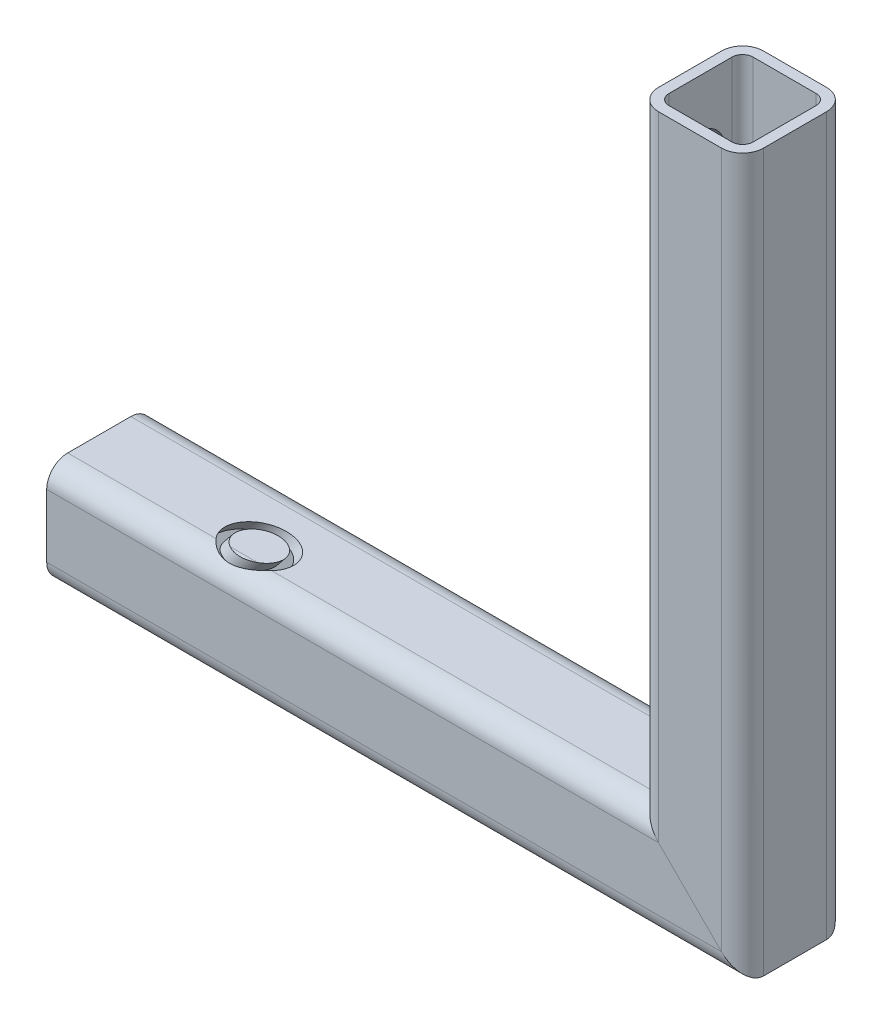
ISO-10303-21;
HEADER;
FILE_DESCRIPTION(('STEP AP214'),'2;1');
FILE_NAME('part.step','',(''),(''),'','','');
FILE_SCHEMA(('AUTOMOTIVE_DESIGN { 1 0 10303 214 1 1 1 1 }'));
ENDSEC;
DATA;
#1=APPLICATION_CONTEXT('core data for automotive mechanical design processes');
#2=APPLICATION_PROTOCOL_DEFINITION('international standard','automotive_design',2000,#1);
#3=PRODUCT_CONTEXT('',#1,'mechanical');
#4=PRODUCT('Part','Part','',(#3));
#5=PRODUCT_RELATED_PRODUCT_CATEGORY('part','',(#4));
#6=PRODUCT_DEFINITION_FORMATION('','',#4);
#7=PRODUCT_DEFINITION_CONTEXT('part definition',#1,'design');
#8=PRODUCT_DEFINITION('design','',#6,#7);
#9=PRODUCT_DEFINITION_SHAPE('','',#8);
#10=(LENGTH_UNIT() NAMED_UNIT(*) SI_UNIT(.MILLI.,.METRE.));
#11=(NAMED_UNIT(*) PLANE_ANGLE_UNIT() SI_UNIT($,.RADIAN.));
#12=(NAMED_UNIT(*) SI_UNIT($,.STERADIAN.) SOLID_ANGLE_UNIT());
#13=UNCERTAINTY_MEASURE_WITH_UNIT(LENGTH_MEASURE(1.E-05),#10,'distance_accuracy_value','');
#14=(GEOMETRIC_REPRESENTATION_CONTEXT(3) GLOBAL_UNCERTAINTY_ASSIGNED_CONTEXT((#13)) GLOBAL_UNIT_ASSIGNED_CONTEXT((#10,
#11,#12)) REPRESENTATION_CONTEXT('',''));
#15=CARTESIAN_POINT('',(0.,0.,0.));
#16=DIRECTION('',(0.,0.,1.));
#17=DIRECTION('',(1.,0.,0.));
#18=AXIS2_PLACEMENT_3D('',#15,#16,#17);
#19=CARTESIAN_POINT('',(-16.,252.925477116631,-12.));
#20=DIRECTION('',(1.,0.,0.));
#21=DIRECTION('',(0.,0.,-1.));
#22=AXIS2_PLACEMENT_3D('',#19,#20,#21);
#23=PLANE('',#22);
#24=DIRECTION('',(0.,0.,1.));
#25=VECTOR('',#24,1.);
#26=CARTESIAN_POINT('',(-16.,16.,-12.));
#27=LINE('',#26,#25);
#28=CARTESIAN_POINT('',(-16.,16.,-12.));
#29=VERTEX_POINT('',#28);
#30=CARTESIAN_POINT('',(-16.,16.,12.));
#31=VERTEX_POINT('',#30);
#32=EDGE_CURVE('E169',#29,#31,#27,.T.);
#33=ORIENTED_EDGE('',*,*,#32,.F.);
#34=DIRECTION('',(0.,-1.,0.));
#35=VECTOR('',#34,1.);
#36=CARTESIAN_POINT('',(-16.,252.925477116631,-12.));
#37=LINE('',#36,#35);
#38=CARTESIAN_POINT('',(-16.,252.925477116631,-12.));
#39=VERTEX_POINT('',#38);
#40=EDGE_CURVE('E243',#39,#29,#37,.T.);
#41=ORIENTED_EDGE('',*,*,#40,.F.);
#42=DIRECTION('',(0.,0.,1.));
#43=VECTOR('',#42,1.);
#44=CARTESIAN_POINT('',(-16.,252.925477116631,-12.));
#45=LINE('',#44,#43);
#46=CARTESIAN_POINT('',(-16.,252.925477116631,12.));
#47=VERTEX_POINT('',#46);
#48=EDGE_CURVE('E244',#39,#47,#45,.T.);
#49=ORIENTED_EDGE('',*,*,#48,.T.);
#50=DIRECTION('',(0.,-1.,0.));
#51=VECTOR('',#50,1.);
#52=CARTESIAN_POINT('',(-16.,252.925477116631,12.));
#53=LINE('',#52,#51);
#54=EDGE_CURVE('E247',#47,#31,#53,.T.);
#55=ORIENTED_EDGE('',*,*,#54,.T.);
#56=EDGE_LOOP('',(#33,#41,#49,#55));
#57=FACE_BOUND('',#56,.T.);
#58=CARTESIAN_POINT('',(-16.,218.289921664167,-0.626500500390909));
#59=DIRECTION('',(1.,0.,0.));
#60=DIRECTION('',(0.,0.999395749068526,-0.0347582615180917));
#61=AXIS2_PLACEMENT_3D('',#58,#59,#60);
#62=ELLIPSE('',#61,15.8313062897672,10.);
#63=CARTESIAN_POINT('',(-16.,234.111661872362,-1.17676918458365));
#64=VERTEX_POINT('',#63);
#65=EDGE_CURVE('E51',#64,#64,#62,.F.);
#66=ORIENTED_EDGE('',*,*,#65,.T.);
#67=EDGE_LOOP('',(#66));
#68=FACE_BOUND('',#67,.T.);
#69=ADVANCED_FACE('F48',(#57,#68),#23,.T.);
#70=CARTESIAN_POINT('',(-20.,252.925477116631,-12.));
#71=DIRECTION('',(1.,0.,0.));
#72=DIRECTION('',(0.,0.,-1.));
#73=AXIS2_PLACEMENT_3D('',#70,#71,#72);
#74=PLANE('',#73);
#75=DIRECTION('',(0.,-1.,0.));
#76=VECTOR('',#75,1.);
#77=CARTESIAN_POINT('',(-20.,252.925477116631,-12.));
#78=LINE('',#77,#76);
#79=CARTESIAN_POINT('',(-20.,252.925477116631,-12.));
#80=VERTEX_POINT('',#79);
#81=CARTESIAN_POINT('',(-20.,20.,-12.));
#82=VERTEX_POINT('',#81);
#83=EDGE_CURVE('E197',#80,#82,#78,.T.);
#84=ORIENTED_EDGE('',*,*,#83,.T.);
#85=DIRECTION('',(0.,0.,1.));
#86=VECTOR('',#85,1.);
#87=CARTESIAN_POINT('',(-20.,20.,-12.));
#88=LINE('',#87,#86);
#89=CARTESIAN_POINT('',(-20.,20.,12.));
#90=VERTEX_POINT('',#89);
#91=EDGE_CURVE('E195',#82,#90,#88,.T.);
#92=ORIENTED_EDGE('',*,*,#91,.T.);
#93=DIRECTION('',(0.,-1.,0.));
#94=VECTOR('',#93,1.);
#95=CARTESIAN_POINT('',(-20.,252.925477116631,12.));
#96=LINE('',#95,#94);
#97=CARTESIAN_POINT('',(-20.,252.925477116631,12.));
#98=VERTEX_POINT('',#97);
#99=EDGE_CURVE('E200',#98,#90,#96,.T.);
#100=ORIENTED_EDGE('',*,*,#99,.F.);
#101=DIRECTION('',(0.,0.,1.));
#102=VECTOR('',#101,1.);
#103=CARTESIAN_POINT('',(-20.,252.925477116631,-12.));
#104=LINE('',#103,#102);
#105=EDGE_CURVE('E225',#80,#98,#104,.T.);
#106=ORIENTED_EDGE('',*,*,#105,.F.);
#107=EDGE_LOOP('',(#84,#92,#100,#106));
#108=FACE_BOUND('',#107,.T.);
#109=CARTESIAN_POINT('',(-20.,213.383627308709,-0.455863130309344));
#110=DIRECTION('',(1.,0.,0.));
#111=DIRECTION('',(0.,0.999395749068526,-0.0347582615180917));
#112=AXIS2_PLACEMENT_3D('',#109,#110,#111);
#113=ELLIPSE('',#112,15.8313062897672,10.);
#114=CARTESIAN_POINT('',(-20.,229.205367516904,-1.00613181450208));
#115=VERTEX_POINT('',#114);
#116=EDGE_CURVE('E12',#115,#115,#113,.F.);
#117=ORIENTED_EDGE('',*,*,#116,.F.);
#118=EDGE_LOOP('',(#117));
#119=FACE_BOUND('',#118,.T.);
#120=ADVANCED_FACE('F336',(#108,#119),#74,.F.);
#121=CARTESIAN_POINT('',(-12.,252.925477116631,-16.));
#122=DIRECTION('',(0.,0.,1.));
#123=DIRECTION('',(1.,0.,0.));
#124=AXIS2_PLACEMENT_3D('',#121,#122,#123);
#125=PLANE('',#124);
#126=DIRECTION('',(-0.707106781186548,0.707106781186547,0.));
#127=VECTOR('',#126,1.);
#128=CARTESIAN_POINT('',(-132.462738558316,132.462738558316,-16.));
#129=LINE('',#128,#127);
#130=CARTESIAN_POINT('',(12.,-12.,-16.));
#131=VERTEX_POINT('',#130);
#132=CARTESIAN_POINT('',(-12.,12.,-16.));
#133=VERTEX_POINT('',#132);
#134=EDGE_CURVE('E157',#131,#133,#129,.T.);
#135=ORIENTED_EDGE('',*,*,#134,.F.);
#136=DIRECTION('',(0.,-1.,0.));
#137=VECTOR('',#136,1.);
#138=CARTESIAN_POINT('',(12.,252.925477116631,-16.));
#139=LINE('',#138,#137);
#140=CARTESIAN_POINT('',(12.,252.925477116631,-16.));
#141=VERTEX_POINT('',#140);
#142=EDGE_CURVE('E147',#141,#131,#139,.T.);
#143=ORIENTED_EDGE('',*,*,#142,.F.);
#144=DIRECTION('',(-1.,0.,0.));
#145=VECTOR('',#144,1.);
#146=CARTESIAN_POINT('',(-12.,252.925477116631,-16.));
#147=LINE('',#146,#145);
#148=CARTESIAN_POINT('',(-12.,252.925477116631,-16.));
#149=VERTEX_POINT('',#148);
#150=EDGE_CURVE('E146',#141,#149,#147,.T.);
#151=ORIENTED_EDGE('',*,*,#150,.T.);
#152=DIRECTION('',(0.,-1.,0.));
#153=VECTOR('',#152,1.);
#154=CARTESIAN_POINT('',(-12.,252.925477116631,-16.));
#155=LINE('',#154,#153);
#156=EDGE_CURVE('E239',#149,#133,#155,.T.);
#157=ORIENTED_EDGE('',*,*,#156,.T.);
#158=EDGE_LOOP('',(#135,#143,#151,#157));
#159=FACE_BOUND('',#158,.T.);
#160=ADVANCED_FACE('F315',(#159),#125,.T.);
#161=CARTESIAN_POINT('',(-12.,252.925477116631,-12.));
#162=DIRECTION('',(0.,-1.,0.));
#163=DIRECTION('',(0.,0.,-1.));
#164=AXIS2_PLACEMENT_3D('',#161,#162,#163);
#165=CYLINDRICAL_SURFACE('',#164,4.);
#166=CARTESIAN_POINT('',(-12.,12.,-12.));
#167=DIRECTION('',(0.707106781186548,0.707106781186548,0.));
#168=DIRECTION('',(0.707106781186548,-0.707106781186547,0.));
#169=AXIS2_PLACEMENT_3D('',#166,#167,#168);
#170=ELLIPSE('',#169,5.65685424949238,4.);
#171=EDGE_CURVE('E172',#133,#29,#170,.T.);
#172=ORIENTED_EDGE('',*,*,#171,.F.);
#173=ORIENTED_EDGE('',*,*,#156,.F.);
#174=CARTESIAN_POINT('',(-12.,252.925477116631,-12.));
#175=DIRECTION('',(0.,1.,0.));
#176=DIRECTION('',(0.,0.,-1.));
#177=AXIS2_PLACEMENT_3D('',#174,#175,#176);
#178=CIRCLE('',#177,4.);
#179=EDGE_CURVE('E240',#149,#39,#178,.T.);
#180=ORIENTED_EDGE('',*,*,#179,.T.);
#181=ORIENTED_EDGE('',*,*,#40,.T.);
#182=EDGE_LOOP('',(#172,#173,#180,#181));
#183=FACE_BOUND('',#182,.T.);
#184=ADVANCED_FACE('F317',(#183),#165,.F.);
#185=CARTESIAN_POINT('',(-12.,252.925477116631,12.));
#186=DIRECTION('',(0.,-1.,0.));
#187=DIRECTION('',(0.,0.,-1.));
#188=AXIS2_PLACEMENT_3D('',#185,#186,#187);
#189=CYLINDRICAL_SURFACE('',#188,4.);
#190=CARTESIAN_POINT('',(-12.,12.,12.));
#191=DIRECTION('',(0.707106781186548,0.707106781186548,0.));
#192=DIRECTION('',(0.707106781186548,-0.707106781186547,0.));
#193=AXIS2_PLACEMENT_3D('',#190,#191,#192);
#194=ELLIPSE('',#193,5.65685424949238,4.);
#195=CARTESIAN_POINT('',(-12.,12.,16.));
#196=VERTEX_POINT('',#195);
#197=EDGE_CURVE('E166',#31,#196,#194,.T.);
#198=ORIENTED_EDGE('',*,*,#197,.F.);
#199=ORIENTED_EDGE('',*,*,#54,.F.);
#200=CARTESIAN_POINT('',(-12.,252.925477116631,12.));
#201=DIRECTION('',(0.,1.,0.));
#202=DIRECTION('',(0.,0.,-1.));
#203=AXIS2_PLACEMENT_3D('',#200,#201,#202);
#204=CIRCLE('',#203,4.);
#205=CARTESIAN_POINT('',(-12.,252.925477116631,16.));
#206=VERTEX_POINT('',#205);
#207=EDGE_CURVE('E248',#47,#206,#204,.T.);
#208=ORIENTED_EDGE('',*,*,#207,.T.);
#209=DIRECTION('',(0.,-1.,0.));
#210=VECTOR('',#209,1.);
#211=CARTESIAN_POINT('',(-12.,252.925477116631,16.));
#212=LINE('',#211,#210);
#213=EDGE_CURVE('E250',#206,#196,#212,.T.);
#214=ORIENTED_EDGE('',*,*,#213,.T.);
#215=EDGE_LOOP('',(#198,#199,#208,#214));
#216=FACE_BOUND('',#215,.T.);
#217=ADVANCED_FACE('F324',(#216),#189,.F.);
#218=CARTESIAN_POINT('',(12.,252.925477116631,16.));
#219=DIRECTION('',(0.,0.,-1.));
#220=DIRECTION('',(-1.,0.,0.));
#221=AXIS2_PLACEMENT_3D('',#218,#219,#220);
#222=PLANE('',#221);
#223=DIRECTION('',(0.707106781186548,-0.707106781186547,0.));
#224=VECTOR('',#223,1.);
#225=CARTESIAN_POINT('',(-120.462738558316,120.462738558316,16.));
#226=LINE('',#225,#224);
#227=CARTESIAN_POINT('',(12.,-12.,16.));
#228=VERTEX_POINT('',#227);
#229=EDGE_CURVE('E163',#196,#228,#226,.T.);
#230=ORIENTED_EDGE('',*,*,#229,.F.);
#231=ORIENTED_EDGE('',*,*,#213,.F.);
#232=DIRECTION('',(1.,0.,0.));
#233=VECTOR('',#232,1.);
#234=CARTESIAN_POINT('',(12.,252.925477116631,16.));
#235=LINE('',#234,#233);
#236=CARTESIAN_POINT('',(12.,252.925477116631,16.));
#237=VERTEX_POINT('',#236);
#238=EDGE_CURVE('E251',#206,#237,#235,.T.);
#239=ORIENTED_EDGE('',*,*,#238,.T.);
#240=DIRECTION('',(0.,-1.,0.));
#241=VECTOR('',#240,1.);
#242=CARTESIAN_POINT('',(12.,252.925477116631,16.));
#243=LINE('',#242,#241);
#244=EDGE_CURVE('E253',#237,#228,#243,.T.);
#245=ORIENTED_EDGE('',*,*,#244,.T.);
#246=EDGE_LOOP('',(#230,#231,#239,#245));
#247=FACE_BOUND('',#246,.T.);
#248=ADVANCED_FACE('F326',(#247),#222,.T.);
#249=CARTESIAN_POINT('',(12.,252.925477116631,12.));
#250=DIRECTION('',(0.,-1.,0.));
#251=DIRECTION('',(0.,0.,-1.));
#252=AXIS2_PLACEMENT_3D('',#249,#250,#251);
#253=CYLINDRICAL_SURFACE('',#252,4.);
#254=CARTESIAN_POINT('',(12.,-12.,12.));
#255=DIRECTION('',(0.707106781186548,0.707106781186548,0.));
#256=DIRECTION('',(0.707106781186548,-0.707106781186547,0.));
#257=AXIS2_PLACEMENT_3D('',#254,#255,#256);
#258=ELLIPSE('',#257,5.65685424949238,4.);
#259=CARTESIAN_POINT('',(16.,-15.9999999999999,12.));
#260=VERTEX_POINT('',#259);
#261=EDGE_CURVE('E160',#228,#260,#258,.T.);
#262=ORIENTED_EDGE('',*,*,#261,.F.);
#263=ORIENTED_EDGE('',*,*,#244,.F.);
#264=CARTESIAN_POINT('',(12.,252.925477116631,12.));
#265=DIRECTION('',(0.,1.,0.));
#266=DIRECTION('',(0.,0.,-1.));
#267=AXIS2_PLACEMENT_3D('',#264,#265,#266);
#268=CIRCLE('',#267,4.);
#269=CARTESIAN_POINT('',(16.,252.925477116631,12.));
#270=VERTEX_POINT('',#269);
#271=EDGE_CURVE('E151',#237,#270,#268,.T.);
#272=ORIENTED_EDGE('',*,*,#271,.T.);
#273=DIRECTION('',(0.,-1.,0.));
#274=VECTOR('',#273,1.);
#275=CARTESIAN_POINT('',(16.,252.925477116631,12.));
#276=LINE('',#275,#274);
#277=EDGE_CURVE('E121',#270,#260,#276,.T.);
#278=ORIENTED_EDGE('',*,*,#277,.T.);
#279=EDGE_LOOP('',(#262,#263,#272,#278));
#280=FACE_BOUND('',#279,.T.);
#281=ADVANCED_FACE('F332',(#280),#253,.F.);
#282=CARTESIAN_POINT('',(16.,252.925477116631,12.));
#283=DIRECTION('',(-1.,0.,0.));
#284=DIRECTION('',(0.,0.,1.));
#285=AXIS2_PLACEMENT_3D('',#282,#283,#284);
#286=PLANE('',#285);
#287=DIRECTION('',(0.,0.,-1.));
#288=VECTOR('',#287,1.);
#289=CARTESIAN_POINT('',(16.,-16.,12.));
#290=LINE('',#289,#288);
#291=CARTESIAN_POINT('',(16.,-16.,-12.));
#292=VERTEX_POINT('',#291);
#293=EDGE_CURVE('E57',#260,#292,#290,.T.);
#294=ORIENTED_EDGE('',*,*,#293,.F.);
#295=ORIENTED_EDGE('',*,*,#277,.F.);
#296=DIRECTION('',(0.,0.,-1.));
#297=VECTOR('',#296,1.);
#298=CARTESIAN_POINT('',(16.,252.925477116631,12.));
#299=LINE('',#298,#297);
#300=CARTESIAN_POINT('',(16.,252.925477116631,-12.));
#301=VERTEX_POINT('',#300);
#302=EDGE_CURVE('E137',#270,#301,#299,.T.);
#303=ORIENTED_EDGE('',*,*,#302,.T.);
#304=DIRECTION('',(0.,-1.,0.));
#305=VECTOR('',#304,1.);
#306=CARTESIAN_POINT('',(16.,252.925477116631,-12.));
#307=LINE('',#306,#305);
#308=EDGE_CURVE('E128',#301,#292,#307,.T.);
#309=ORIENTED_EDGE('',*,*,#308,.T.);
#310=EDGE_LOOP('',(#294,#295,#303,#309));
#311=FACE_BOUND('',#310,.T.);
#312=ADVANCED_FACE('F149',(#311),#286,.T.);
#313=CARTESIAN_POINT('',(12.,252.925477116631,-12.));
#314=DIRECTION('',(0.,-1.,0.));
#315=DIRECTION('',(0.,0.,-1.));
#316=AXIS2_PLACEMENT_3D('',#313,#314,#315);
#317=CYLINDRICAL_SURFACE('',#316,4.);
#318=CARTESIAN_POINT('',(12.,-12.,-12.));
#319=DIRECTION('',(0.707106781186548,0.707106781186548,0.));
#320=DIRECTION('',(0.707106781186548,-0.707106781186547,0.));
#321=AXIS2_PLACEMENT_3D('',#318,#319,#320);
#322=ELLIPSE('',#321,5.65685424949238,4.);
#323=EDGE_CURVE('E136',#292,#131,#322,.T.);
#324=ORIENTED_EDGE('',*,*,#323,.F.);
#325=ORIENTED_EDGE('',*,*,#308,.F.);
#326=CARTESIAN_POINT('',(12.,252.925477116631,-12.));
#327=DIRECTION('',(0.,1.,0.));
#328=DIRECTION('',(0.,0.,-1.));
#329=AXIS2_PLACEMENT_3D('',#326,#327,#328);
#330=CIRCLE('',#329,4.);
#331=EDGE_CURVE('E132',#301,#141,#330,.T.);
#332=ORIENTED_EDGE('',*,*,#331,.T.);
#333=ORIENTED_EDGE('',*,*,#142,.T.);
#334=EDGE_LOOP('',(#324,#325,#332,#333));
#335=FACE_BOUND('',#334,.T.);
#336=ADVANCED_FACE('F130',(#335),#317,.F.);
#337=CARTESIAN_POINT('',(12.,252.925477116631,12.));
#338=DIRECTION('',(0.,1.,0.));
#339=DIRECTION('',(0.,0.,-1.));
#340=AXIS2_PLACEMENT_3D('',#337,#338,#339);
#341=PLANE('',#340);
#342=ORIENTED_EDGE('',*,*,#331,.F.);
#343=ORIENTED_EDGE('',*,*,#302,.F.);
#344=ORIENTED_EDGE('',*,*,#271,.F.);
#345=ORIENTED_EDGE('',*,*,#238,.F.);
#346=ORIENTED_EDGE('',*,*,#207,.F.);
#347=ORIENTED_EDGE('',*,*,#48,.F.);
#348=ORIENTED_EDGE('',*,*,#179,.F.);
#349=ORIENTED_EDGE('',*,*,#150,.F.);
#350=EDGE_LOOP('',(#342,#343,#344,#345,#346,#347,#348,#349));
#351=FACE_BOUND('',#350,.T.);
#352=CARTESIAN_POINT('',(12.,252.925477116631,12.));
#353=DIRECTION('',(0.,1.,0.));
#354=DIRECTION('',(0.,0.,-1.));
#355=AXIS2_PLACEMENT_3D('',#352,#353,#354);
#356=CIRCLE('',#355,8.);
#357=CARTESIAN_POINT('',(12.,252.925477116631,20.));
#358=VERTEX_POINT('',#357);
#359=CARTESIAN_POINT('',(20.,252.925477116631,12.));
#360=VERTEX_POINT('',#359);
#361=EDGE_CURVE('E235',#358,#360,#356,.T.);
#362=ORIENTED_EDGE('',*,*,#361,.T.);
#363=DIRECTION('',(0.,0.,-1.));
#364=VECTOR('',#363,1.);
#365=CARTESIAN_POINT('',(20.,252.925477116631,12.));
#366=LINE('',#365,#364);
#367=CARTESIAN_POINT('',(20.,252.925477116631,-12.));
#368=VERTEX_POINT('',#367);
#369=EDGE_CURVE('E233',#360,#368,#366,.T.);
#370=ORIENTED_EDGE('',*,*,#369,.T.);
#371=CARTESIAN_POINT('',(12.,252.925477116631,-12.));
#372=DIRECTION('',(0.,1.,0.));
#373=DIRECTION('',(0.,0.,-1.));
#374=AXIS2_PLACEMENT_3D('',#371,#372,#373);
#375=CIRCLE('',#374,8.);
#376=CARTESIAN_POINT('',(12.,252.925477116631,-20.));
#377=VERTEX_POINT('',#376);
#378=EDGE_CURVE('E231',#368,#377,#375,.T.);
#379=ORIENTED_EDGE('',*,*,#378,.T.);
#380=DIRECTION('',(-1.,0.,0.));
#381=VECTOR('',#380,1.);
#382=CARTESIAN_POINT('',(-12.,252.925477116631,-20.));
#383=LINE('',#382,#381);
#384=CARTESIAN_POINT('',(-12.,252.925477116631,-20.));
#385=VERTEX_POINT('',#384);
#386=EDGE_CURVE('E229',#377,#385,#383,.T.);
#387=ORIENTED_EDGE('',*,*,#386,.T.);
#388=CARTESIAN_POINT('',(-12.,252.925477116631,-12.));
#389=DIRECTION('',(0.,1.,0.));
#390=DIRECTION('',(0.,0.,-1.));
#391=AXIS2_PLACEMENT_3D('',#388,#389,#390);
#392=CIRCLE('',#391,8.);
#393=EDGE_CURVE('E227',#385,#80,#392,.T.);
#394=ORIENTED_EDGE('',*,*,#393,.T.);
#395=ORIENTED_EDGE('',*,*,#105,.T.);
#396=CARTESIAN_POINT('',(-12.,252.925477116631,12.));
#397=DIRECTION('',(0.,1.,0.));
#398=DIRECTION('',(0.,0.,-1.));
#399=AXIS2_PLACEMENT_3D('',#396,#397,#398);
#400=CIRCLE('',#399,8.);
#401=CARTESIAN_POINT('',(-12.,252.925477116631,20.));
#402=VERTEX_POINT('',#401);
#403=EDGE_CURVE('E223',#98,#402,#400,.T.);
#404=ORIENTED_EDGE('',*,*,#403,.T.);
#405=DIRECTION('',(1.,0.,0.));
#406=VECTOR('',#405,1.);
#407=CARTESIAN_POINT('',(12.,252.925477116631,20.));
#408=LINE('',#407,#406);
#409=EDGE_CURVE('E220',#402,#358,#408,.T.);
#410=ORIENTED_EDGE('',*,*,#409,.T.);
#411=EDGE_LOOP('',(#362,#370,#379,#387,#394,#395,#404,#410));
#412=FACE_BOUND('',#411,.T.);
#413=ADVANCED_FACE('F140',(#351,#412),#341,.T.);
#414=CARTESIAN_POINT('',(12.,252.925477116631,20.));
#415=DIRECTION('',(0.,0.,-1.));
#416=DIRECTION('',(-1.,0.,0.));
#417=AXIS2_PLACEMENT_3D('',#414,#415,#416);
#418=PLANE('',#417);
#419=DIRECTION('',(0.,-1.,0.));
#420=VECTOR('',#419,1.);
#421=CARTESIAN_POINT('',(-12.,252.925477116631,20.));
#422=LINE('',#421,#420);
#423=CARTESIAN_POINT('',(-12.,12.,20.));
#424=VERTEX_POINT('',#423);
#425=EDGE_CURVE('E215',#402,#424,#422,.T.);
#426=ORIENTED_EDGE('',*,*,#425,.T.);
#427=DIRECTION('',(0.707106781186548,-0.707106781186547,0.));
#428=VECTOR('',#427,1.);
#429=CARTESIAN_POINT('',(-120.462738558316,120.462738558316,20.));
#430=LINE('',#429,#428);
#431=CARTESIAN_POINT('',(12.,-12.,20.));
#432=VERTEX_POINT('',#431);
#433=EDGE_CURVE('E209',#424,#432,#430,.T.);
#434=ORIENTED_EDGE('',*,*,#433,.T.);
#435=DIRECTION('',(0.,-1.,0.));
#436=VECTOR('',#435,1.);
#437=CARTESIAN_POINT('',(12.,252.925477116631,20.));
#438=LINE('',#437,#436);
#439=EDGE_CURVE('E178',#358,#432,#438,.T.);
#440=ORIENTED_EDGE('',*,*,#439,.F.);
#441=ORIENTED_EDGE('',*,*,#409,.F.);
#442=EDGE_LOOP('',(#426,#434,#440,#441));
#443=FACE_BOUND('',#442,.T.);
#444=ADVANCED_FACE('F357',(#443),#418,.F.);
#445=CARTESIAN_POINT('',(-12.,252.925477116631,12.));
#446=DIRECTION('',(0.,-1.,0.));
#447=DIRECTION('',(0.,0.,-1.));
#448=AXIS2_PLACEMENT_3D('',#445,#446,#447);
#449=CYLINDRICAL_SURFACE('',#448,8.);
#450=ORIENTED_EDGE('',*,*,#99,.T.);
#451=CARTESIAN_POINT('',(-12.,12.,12.));
#452=DIRECTION('',(0.707106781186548,0.707106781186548,0.));
#453=DIRECTION('',(0.707106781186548,-0.707106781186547,0.));
#454=AXIS2_PLACEMENT_3D('',#451,#452,#453);
#455=ELLIPSE('',#454,11.3137084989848,8.);
#456=EDGE_CURVE('E198',#90,#424,#455,.T.);
#457=ORIENTED_EDGE('',*,*,#456,.T.);
#458=ORIENTED_EDGE('',*,*,#425,.F.);
#459=ORIENTED_EDGE('',*,*,#403,.F.);
#460=EDGE_LOOP('',(#450,#457,#458,#459));
#461=FACE_BOUND('',#460,.T.);
#462=ADVANCED_FACE('F360',(#461),#449,.T.);
#463=CARTESIAN_POINT('',(-12.,252.925477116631,-12.));
#464=DIRECTION('',(0.,-1.,0.));
#465=DIRECTION('',(0.,0.,-1.));
#466=AXIS2_PLACEMENT_3D('',#463,#464,#465);
#467=CYLINDRICAL_SURFACE('',#466,8.);
#468=DIRECTION('',(0.,-1.,0.));
#469=VECTOR('',#468,1.);
#470=CARTESIAN_POINT('',(-12.,252.925477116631,-20.));
#471=LINE('',#470,#469);
#472=CARTESIAN_POINT('',(-12.,12.,-20.));
#473=VERTEX_POINT('',#472);
#474=EDGE_CURVE('E194',#385,#473,#471,.T.);
#475=ORIENTED_EDGE('',*,*,#474,.T.);
#476=CARTESIAN_POINT('',(-12.,12.,-12.));
#477=DIRECTION('',(0.707106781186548,0.707106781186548,0.));
#478=DIRECTION('',(0.707106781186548,-0.707106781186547,0.));
#479=AXIS2_PLACEMENT_3D('',#476,#477,#478);
#480=ELLIPSE('',#479,11.3137084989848,8.);
#481=EDGE_CURVE('E191',#473,#82,#480,.T.);
#482=ORIENTED_EDGE('',*,*,#481,.T.);
#483=ORIENTED_EDGE('',*,*,#83,.F.);
#484=ORIENTED_EDGE('',*,*,#393,.F.);
#485=EDGE_LOOP('',(#475,#482,#483,#484));
#486=FACE_BOUND('',#485,.T.);
#487=ADVANCED_FACE('F364',(#486),#467,.T.);
#488=CARTESIAN_POINT('',(-12.,252.925477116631,-20.));
#489=DIRECTION('',(0.,0.,1.));
#490=DIRECTION('',(1.,0.,0.));
#491=AXIS2_PLACEMENT_3D('',#488,#489,#490);
#492=PLANE('',#491);
#493=DIRECTION('',(0.,-1.,0.));
#494=VECTOR('',#493,1.);
#495=CARTESIAN_POINT('',(12.,252.925477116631,-20.));
#496=LINE('',#495,#494);
#497=CARTESIAN_POINT('',(12.,-12.,-20.));
#498=VERTEX_POINT('',#497);
#499=EDGE_CURVE('E190',#377,#498,#496,.T.);
#500=ORIENTED_EDGE('',*,*,#499,.T.);
#501=DIRECTION('',(-0.707106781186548,0.707106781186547,0.));
#502=VECTOR('',#501,1.);
#503=CARTESIAN_POINT('',(-132.462738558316,132.462738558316,-20.));
#504=LINE('',#503,#502);
#505=EDGE_CURVE('E187',#498,#473,#504,.T.);
#506=ORIENTED_EDGE('',*,*,#505,.T.);
#507=ORIENTED_EDGE('',*,*,#474,.F.);
#508=ORIENTED_EDGE('',*,*,#386,.F.);
#509=EDGE_LOOP('',(#500,#506,#507,#508));
#510=FACE_BOUND('',#509,.T.);
#511=ADVANCED_FACE('F280',(#510),#492,.F.);
#512=CARTESIAN_POINT('',(12.,252.925477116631,-12.));
#513=DIRECTION('',(0.,-1.,0.));
#514=DIRECTION('',(0.,0.,-1.));
#515=AXIS2_PLACEMENT_3D('',#512,#513,#514);
#516=CYLINDRICAL_SURFACE('',#515,8.);
#517=DIRECTION('',(0.,-1.,0.));
#518=VECTOR('',#517,1.);
#519=CARTESIAN_POINT('',(20.,252.925477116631,-12.));
#520=LINE('',#519,#518);
#521=CARTESIAN_POINT('',(20.,-20.,-12.));
#522=VERTEX_POINT('',#521);
#523=EDGE_CURVE('E186',#368,#522,#520,.T.);
#524=ORIENTED_EDGE('',*,*,#523,.T.);
#525=CARTESIAN_POINT('',(12.,-12.,-12.));
#526=DIRECTION('',(0.707106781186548,0.707106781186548,0.));
#527=DIRECTION('',(0.707106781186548,-0.707106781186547,0.));
#528=AXIS2_PLACEMENT_3D('',#525,#526,#527);
#529=ELLIPSE('',#528,11.3137084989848,8.);
#530=EDGE_CURVE('E183',#522,#498,#529,.T.);
#531=ORIENTED_EDGE('',*,*,#530,.T.);
#532=ORIENTED_EDGE('',*,*,#499,.F.);
#533=ORIENTED_EDGE('',*,*,#378,.F.);
#534=EDGE_LOOP('',(#524,#531,#532,#533));
#535=FACE_BOUND('',#534,.T.);
#536=ADVANCED_FACE('F288',(#535),#516,.T.);
#537=CARTESIAN_POINT('',(20.,252.925477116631,12.));
#538=DIRECTION('',(-1.,0.,0.));
#539=DIRECTION('',(0.,0.,1.));
#540=AXIS2_PLACEMENT_3D('',#537,#538,#539);
#541=PLANE('',#540);
#542=DIRECTION('',(0.,-1.,0.));
#543=VECTOR('',#542,1.);
#544=CARTESIAN_POINT('',(20.,252.925477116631,12.));
#545=LINE('',#544,#543);
#546=CARTESIAN_POINT('',(20.,-20.,12.));
#547=VERTEX_POINT('',#546);
#548=EDGE_CURVE('E182',#360,#547,#545,.T.);
#549=ORIENTED_EDGE('',*,*,#548,.T.);
#550=DIRECTION('',(0.,0.,-1.));
#551=VECTOR('',#550,1.);
#552=CARTESIAN_POINT('',(20.,-20.,12.));
#553=LINE('',#552,#551);
#554=EDGE_CURVE('E179',#547,#522,#553,.T.);
#555=ORIENTED_EDGE('',*,*,#554,.T.);
#556=ORIENTED_EDGE('',*,*,#523,.F.);
#557=ORIENTED_EDGE('',*,*,#369,.F.);
#558=EDGE_LOOP('',(#549,#555,#556,#557));
#559=FACE_BOUND('',#558,.T.);
#560=ADVANCED_FACE('F372',(#559),#541,.F.);
#561=CARTESIAN_POINT('',(12.,252.925477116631,12.));
#562=DIRECTION('',(0.,-1.,0.));
#563=DIRECTION('',(0.,0.,-1.));
#564=AXIS2_PLACEMENT_3D('',#561,#562,#563);
#565=CYLINDRICAL_SURFACE('',#564,8.);
#566=ORIENTED_EDGE('',*,*,#439,.T.);
#567=CARTESIAN_POINT('',(12.,-12.,12.));
#568=DIRECTION('',(0.707106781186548,0.707106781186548,0.));
#569=DIRECTION('',(0.707106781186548,-0.707106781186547,0.));
#570=AXIS2_PLACEMENT_3D('',#567,#568,#569);
#571=ELLIPSE('',#570,11.3137084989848,8.);
#572=EDGE_CURVE('E66',#432,#547,#571,.T.);
#573=ORIENTED_EDGE('',*,*,#572,.T.);
#574=ORIENTED_EDGE('',*,*,#548,.F.);
#575=ORIENTED_EDGE('',*,*,#361,.F.);
#576=EDGE_LOOP('',(#566,#573,#574,#575));
#577=FACE_BOUND('',#576,.T.);
#578=ADVANCED_FACE('F354',(#577),#565,.T.);
#579=CARTESIAN_POINT('',(0.,0.,0.));
#580=DIRECTION('',(0.707106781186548,0.707106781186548,0.));
#581=DIRECTION('',(-0.707106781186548,0.707106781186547,0.));
#582=AXIS2_PLACEMENT_3D('',#579,#580,#581);
#583=PLANE('',#582);
#584=ORIENTED_EDGE('',*,*,#323,.T.);
#585=ORIENTED_EDGE('',*,*,#134,.T.);
#586=ORIENTED_EDGE('',*,*,#171,.T.);
#587=ORIENTED_EDGE('',*,*,#32,.T.);
#588=ORIENTED_EDGE('',*,*,#197,.T.);
#589=ORIENTED_EDGE('',*,*,#229,.T.);
#590=ORIENTED_EDGE('',*,*,#261,.T.);
#591=ORIENTED_EDGE('',*,*,#293,.T.);
#592=EDGE_LOOP('',(#584,#585,#586,#587,#588,#589,#590,#591));
#593=FACE_BOUND('',#592,.T.);
#594=ORIENTED_EDGE('',*,*,#433,.F.);
#595=ORIENTED_EDGE('',*,*,#456,.F.);
#596=ORIENTED_EDGE('',*,*,#91,.F.);
#597=ORIENTED_EDGE('',*,*,#481,.F.);
#598=ORIENTED_EDGE('',*,*,#505,.F.);
#599=ORIENTED_EDGE('',*,*,#530,.F.);
#600=ORIENTED_EDGE('',*,*,#554,.F.);
#601=ORIENTED_EDGE('',*,*,#572,.F.);
#602=EDGE_LOOP('',(#594,#595,#596,#597,#598,#599,#600,#601));
#603=FACE_BOUND('',#602,.T.);
#604=ADVANCED_FACE('F290',(#593,#603),#583,.F.);
#605=CARTESIAN_POINT('',(-192.898298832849,1.31114040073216,6.91986462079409));
#606=DIRECTION('',(0.631659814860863,0.774777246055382,-0.0269461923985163));
#607=DIRECTION('',(-0.55824998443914,0.43046184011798,-0.709266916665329));
#608=AXIS2_PLACEMENT_3D('',#605,#606,#607);
#609=CYLINDRICAL_SURFACE('',#608,10.);
#610=ORIENTED_EDGE('',*,*,#65,.F.);
#611=EDGE_LOOP('',(#610));
#612=FACE_BOUND('',#611,.T.);
#613=ORIENTED_EDGE('',*,*,#116,.T.);
#614=EDGE_LOOP('',(#613));
#615=FACE_BOUND('',#614,.T.);
#616=ADVANCED_FACE('F348',(#612,#615),#609,.F.);
#617=CLOSED_SHELL('',(#69,#120,#160,#184,#217,#248,#281,#312,#336,#413,#444,#462,#487,#511,#536,
#560,#578,#604,#616));
#618=MANIFOLD_SOLID_BREP('B2',#617);
#619=CARTESIAN_POINT('',(0.,20.,-12.));
#620=DIRECTION('',(0.,-1.,0.));
#621=DIRECTION('',(0.,0.,-1.));
#622=AXIS2_PLACEMENT_3D('',#619,#620,#621);
#623=PLANE('',#622);
#624=CARTESIAN_POINT('',(-177.661659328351,20.,6.26987959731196));
#625=DIRECTION('',(0.,-1.,0.));
#626=DIRECTION('',(0.999091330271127,0.,-0.042620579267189));
#627=AXIS2_PLACEMENT_3D('',#624,#625,#626);
#628=ELLIPSE('',#627,12.9069355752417,10.);
#629=CARTESIAN_POINT('',(-167.249370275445,20.,12.));
#630=VERTEX_POINT('',#629);
#631=CARTESIAN_POINT('',(-188.398508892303,20.,12.));
#632=VERTEX_POINT('',#631);
#633=EDGE_CURVE('E682',#630,#632,#628,.F.);
#634=ORIENTED_EDGE('',*,*,#633,.F.);
#635=DIRECTION('',(-1.,0.,0.));
#636=VECTOR('',#635,1.);
#637=CARTESIAN_POINT('',(0.,20.,12.));
#638=LINE('',#637,#636);
#639=CARTESIAN_POINT('',(-20.,20.,12.));
#640=VERTEX_POINT('',#639);
#641=EDGE_CURVE('E554',#640,#630,#638,.T.);
#642=ORIENTED_EDGE('',*,*,#641,.F.);
#643=DIRECTION('',(0.,0.,1.));
#644=VECTOR('',#643,1.);
#645=CARTESIAN_POINT('',(-20.,20.,-12.));
#646=LINE('',#645,#644);
#647=CARTESIAN_POINT('',(-20.,20.,-12.));
#648=VERTEX_POINT('',#647);
#649=EDGE_CURVE('E876',#648,#640,#646,.T.);
#650=ORIENTED_EDGE('',*,*,#649,.F.);
#651=DIRECTION('',(-1.,0.,0.));
#652=VECTOR('',#651,1.);
#653=CARTESIAN_POINT('',(0.,20.,-12.));
#654=LINE('',#653,#652);
#655=CARTESIAN_POINT('',(-244.857759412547,20.,-12.));
#656=VERTEX_POINT('',#655);
#657=EDGE_CURVE('E702',#648,#656,#654,.T.);
#658=ORIENTED_EDGE('',*,*,#657,.T.);
#659=DIRECTION('',(0.,0.,1.));
#660=VECTOR('',#659,1.);
#661=CARTESIAN_POINT('',(-244.857759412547,20.,-12.));
#662=LINE('',#661,#660);
#663=CARTESIAN_POINT('',(-244.857759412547,20.,12.));
#664=VERTEX_POINT('',#663);
#665=EDGE_CURVE('E698',#656,#664,#662,.T.);
#666=ORIENTED_EDGE('',*,*,#665,.T.);
#667=EDGE_CURVE('E694',#632,#664,#638,.T.);
#668=ORIENTED_EDGE('',*,*,#667,.F.);
#669=EDGE_LOOP('',(#634,#642,#650,#658,#666,#668));
#670=FACE_BOUND('',#669,.T.);
#671=ADVANCED_FACE('F551',(#670),#623,.F.);
#672=CARTESIAN_POINT('',(0.,12.,12.));
#673=DIRECTION('',(-1.,0.,0.));
#674=DIRECTION('',(0.,0.,1.));
#675=AXIS2_PLACEMENT_3D('',#672,#673,#674);
#676=CYLINDRICAL_SURFACE('',#675,8.);
#677=CARTESIAN_POINT('',(-188.398508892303,20.,12.));
#678=CARTESIAN_POINT('',(-188.286567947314,20.0000092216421,12.1283511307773));
#679=CARTESIAN_POINT('',(-188.172823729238,19.996911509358,12.2551216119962));
#680=CARTESIAN_POINT('',(-187.941642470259,19.9850242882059,12.504962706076));
#681=CARTESIAN_POINT('',(-187.824205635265,19.9762350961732,12.628033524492));
#682=CARTESIAN_POINT('',(-187.585572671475,19.9534899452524,12.8699184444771));
#683=CARTESIAN_POINT('',(-187.464377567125,19.9395353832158,12.9887336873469));
#684=CARTESIAN_POINT('',(-187.218144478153,19.907048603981,13.2216454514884));
#685=CARTESIAN_POINT('',(-187.093106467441,19.8885163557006,13.3357419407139));
#686=CARTESIAN_POINT('',(-186.712278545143,19.8269991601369,13.670137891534));
#687=CARTESIAN_POINT('',(-186.450588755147,19.7780741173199,13.88273401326));
#688=CARTESIAN_POINT('',(-185.911556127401,19.6698517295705,14.2839897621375));
#689=CARTESIAN_POINT('',(-185.634214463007,19.61055516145,14.4726511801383));
#690=CARTESIAN_POINT('',(-185.076350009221,19.4900704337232,14.816126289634));
#691=CARTESIAN_POINT('',(-184.796463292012,19.4290697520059,14.9720376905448));
#692=CARTESIAN_POINT('',(-184.223615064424,19.3081227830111,15.2581433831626));
#693=CARTESIAN_POINT('',(-183.930654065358,19.2481764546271,15.3883386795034));
#694=CARTESIAN_POINT('',(-183.334190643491,19.1343101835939,15.6219450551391));
#695=CARTESIAN_POINT('',(-183.030723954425,19.0803720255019,15.7254384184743));
#696=CARTESIAN_POINT('',(-182.414608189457,18.982189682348,15.9063607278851));
#697=CARTESIAN_POINT('',(-182.101959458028,18.9379451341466,15.9837906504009));
#698=CARTESIAN_POINT('',(-181.484543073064,18.8634928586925,16.1106717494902));
#699=CARTESIAN_POINT('',(-181.180069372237,18.8327354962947,16.1612410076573));
#700=CARTESIAN_POINT('',(-180.567400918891,18.7834654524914,16.2410843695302));
#701=CARTESIAN_POINT('',(-180.259206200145,18.7649526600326,16.2703586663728));
#702=CARTESIAN_POINT('',(-179.640329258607,18.7401411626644,16.3094106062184));
#703=CARTESIAN_POINT('',(-179.329642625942,18.7338747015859,16.3191367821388));
#704=CARTESIAN_POINT('',(-178.708205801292,18.7328589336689,16.3207176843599));
#705=CARTESIAN_POINT('',(-178.397455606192,18.7381110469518,16.3125702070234));
#706=CARTESIAN_POINT('',(-177.83464160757,18.7569292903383,16.2830048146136));
#707=CARTESIAN_POINT('',(-177.582365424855,18.7687759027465,16.2643234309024));
#708=CARTESIAN_POINT('',(-177.079092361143,18.7984513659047,16.216852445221));
#709=CARTESIAN_POINT('',(-176.828095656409,18.8162810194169,16.1880614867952));
#710=CARTESIAN_POINT('',(-176.327674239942,18.8570832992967,16.120916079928));
#711=CARTESIAN_POINT('',(-176.078250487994,18.8800588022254,16.0825562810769));
#712=CARTESIAN_POINT('',(-175.581391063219,18.9302963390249,15.9966819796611));
#713=CARTESIAN_POINT('',(-175.333955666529,18.9575589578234,15.9491662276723));
#714=CARTESIAN_POINT('',(-174.840620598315,19.0156206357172,15.8450785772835));
#715=CARTESIAN_POINT('',(-174.594727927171,19.0464302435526,15.7884794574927));
#716=CARTESIAN_POINT('',(-174.105525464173,19.1106929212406,15.6664426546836));
#717=CARTESIAN_POINT('',(-173.862215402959,19.1441457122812,15.6010059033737));
#718=CARTESIAN_POINT('',(-173.378533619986,19.2128759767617,15.4612832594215));
#719=CARTESIAN_POINT('',(-173.13816057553,19.248152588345,15.3870015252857));
#720=CARTESIAN_POINT('',(-172.660577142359,19.3197364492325,15.2293878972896));
#721=CARTESIAN_POINT('',(-172.423366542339,19.3560436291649,15.1460566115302));
#722=CARTESIAN_POINT('',(-171.870028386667,19.4416201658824,14.9391940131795));
#723=CARTESIAN_POINT('',(-171.55534422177,19.4909777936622,14.8118020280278));
#724=CARTESIAN_POINT('',(-170.93366423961,19.5879035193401,14.5386501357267));
#725=CARTESIAN_POINT('',(-170.626669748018,19.6354713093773,14.3928870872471));
#726=CARTESIAN_POINT('',(-170.02451900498,19.7259394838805,14.0822731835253));
#727=CARTESIAN_POINT('',(-169.729293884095,19.7688707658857,13.9175660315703));
#728=CARTESIAN_POINT('',(-169.151484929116,19.8473165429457,13.565922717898));
#729=CARTESIAN_POINT('',(-168.868892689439,19.882836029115,13.3790016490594));
#730=CARTESIAN_POINT('',(-168.354712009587,19.9386537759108,13.0045020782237));
#731=CARTESIAN_POINT('',(-168.121146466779,19.9602940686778,12.8198846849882));
#732=CARTESIAN_POINT('',(-167.783639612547,19.9832909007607,12.5260880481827));
#733=CARTESIAN_POINT('',(-167.672956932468,19.9893832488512,12.4250066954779));
#734=CARTESIAN_POINT('',(-167.456919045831,19.9977324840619,12.2169671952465));
#735=CARTESIAN_POINT('',(-167.351568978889,19.9999857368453,12.1100035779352));
#736=CARTESIAN_POINT('',(-167.249370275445,20.,12.));
#737=B_SPLINE_CURVE_WITH_KNOTS('',3,(#677,#678,#679,#680,#681,#682,#683,#684,#685,#686,#687,
#688,#689,#690,#691,#692,#693,#694,#695,#696,#697,#698,#699,#700,#701,#702,#703,#704,#705,#706,
#707,#708,#709,#710,#711,#712,#713,#714,#715,#716,#717,#718,#719,#720,#721,#722,#723,#724,#725,
#726,#727,#728,#729,#730,#731,#732,#733,#734,#735,#736),.UNSPECIFIED.,.F.,.F.,(4,2,2,2,2,2,2,2,
2,2,2,2,2,2,2,2,2,2,2,2,2,2,2,2,2,2,2,2,2,4),(0.,0.510869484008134,1.02171053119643,
1.53241353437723,2.04312000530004,3.06373561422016,4.08427481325,5.06144391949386,
6.03857484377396,7.01265769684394,7.98670405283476,8.91618221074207,9.84565193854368,
10.7775656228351,11.7095942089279,12.4690456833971,13.2285990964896,13.9885781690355,
14.7486610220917,15.5110657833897,16.2733902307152,17.0353576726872,17.7972739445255,
18.8259136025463,19.8547293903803,20.8762001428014,21.8969807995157,22.7910655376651,
23.240885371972,23.6911307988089),.UNSPECIFIED.);
#738=EDGE_CURVE('E560',#632,#630,#737,.T.);
#739=ORIENTED_EDGE('',*,*,#738,.F.);
#740=ORIENTED_EDGE('',*,*,#667,.T.);
#741=CARTESIAN_POINT('',(-244.857759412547,12.,12.));
#742=DIRECTION('',(1.,0.,0.));
#743=DIRECTION('',(0.,0.,-1.));
#744=AXIS2_PLACEMENT_3D('',#741,#742,#743);
#745=CIRCLE('',#744,8.);
#746=CARTESIAN_POINT('',(-244.857759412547,12.,20.));
#747=VERTEX_POINT('',#746);
#748=EDGE_CURVE('E700',#664,#747,#745,.T.);
#749=ORIENTED_EDGE('',*,*,#748,.T.);
#750=DIRECTION('',(-1.,0.,0.));
#751=VECTOR('',#750,1.);
#752=CARTESIAN_POINT('',(0.,12.,20.));
#753=LINE('',#752,#751);
#754=CARTESIAN_POINT('',(-12.,12.,20.));
#755=VERTEX_POINT('',#754);
#756=EDGE_CURVE('E814',#755,#747,#753,.T.);
#757=ORIENTED_EDGE('',*,*,#756,.F.);
#758=CARTESIAN_POINT('',(-12.,12.,12.));
#759=DIRECTION('',(0.707106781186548,0.707106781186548,0.));
#760=DIRECTION('',(-0.707106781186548,0.707106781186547,0.));
#761=AXIS2_PLACEMENT_3D('',#758,#759,#760);
#762=ELLIPSE('',#761,11.3137084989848,8.);
#763=EDGE_CURVE('E879',#640,#755,#762,.T.);
#764=ORIENTED_EDGE('',*,*,#763,.F.);
#765=ORIENTED_EDGE('',*,*,#641,.T.);
#766=EDGE_LOOP('',(#739,#740,#749,#757,#764,#765));
#767=FACE_BOUND('',#766,.T.);
#768=ADVANCED_FACE('F692',(#767),#676,.T.);
#769=CARTESIAN_POINT('',(0.,-12.,16.));
#770=DIRECTION('',(0.,0.,-1.));
#771=DIRECTION('',(-1.,0.,0.));
#772=AXIS2_PLACEMENT_3D('',#769,#770,#771);
#773=PLANE('',#772);
#774=DIRECTION('',(-1.,0.,0.));
#775=VECTOR('',#774,1.);
#776=CARTESIAN_POINT('',(0.,12.,16.));
#777=LINE('',#776,#775);
#778=CARTESIAN_POINT('',(-188.684730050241,12.,16.));
#779=VERTEX_POINT('',#778);
#780=CARTESIAN_POINT('',(-244.857759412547,12.,16.));
#781=VERTEX_POINT('',#780);
#782=EDGE_CURVE('E724',#779,#781,#777,.T.);
#783=ORIENTED_EDGE('',*,*,#782,.F.);
#784=CARTESIAN_POINT('',(-405.750509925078,-259.767760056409,16.));
#785=DIRECTION('',(0.,0.,-1.));
#786=DIRECTION('',(0.631889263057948,0.775058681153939,0.));
#787=AXIS2_PLACEMENT_3D('',#784,#785,#786);
#788=ELLIPSE('',#787,371.10994578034,10.);
#789=CARTESIAN_POINT('',(-195.985125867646,4.14356698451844,16.));
#790=VERTEX_POINT('',#789);
#791=EDGE_CURVE('E704',#779,#790,#788,.F.);
#792=ORIENTED_EDGE('',*,*,#791,.T.);
#793=DIRECTION('',(-0.775058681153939,0.631889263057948,0.));
#794=VECTOR('',#793,1.);
#795=CARTESIAN_POINT('',(-70.3474007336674,-98.2862637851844,16.));
#796=LINE('',#795,#794);
#797=CARTESIAN_POINT('',(-189.502144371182,-1.14187333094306,16.));
#798=VERTEX_POINT('',#797);
#799=EDGE_CURVE('E46',#798,#790,#796,.T.);
#800=ORIENTED_EDGE('',*,*,#799,.F.);
#801=CARTESIAN_POINT('',(-180.218422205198,12.,16.));
#802=VERTEX_POINT('',#801);
#803=EDGE_CURVE('E706',#798,#802,#788,.F.);
#804=ORIENTED_EDGE('',*,*,#803,.T.);
#805=CARTESIAN_POINT('',(-12.,12.,16.));
#806=VERTEX_POINT('',#805);
#807=EDGE_CURVE('E818',#806,#802,#777,.T.);
#808=ORIENTED_EDGE('',*,*,#807,.F.);
#809=DIRECTION('',(0.707106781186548,-0.707106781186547,0.));
#810=VECTOR('',#809,1.);
#811=CARTESIAN_POINT('',(6.,-6.,16.));
#812=LINE('',#811,#810);
#813=CARTESIAN_POINT('',(12.,-12.,16.));
#814=VERTEX_POINT('',#813);
#815=EDGE_CURVE('E711',#806,#814,#812,.T.);
#816=ORIENTED_EDGE('',*,*,#815,.T.);
#817=DIRECTION('',(-1.,0.,0.));
#818=VECTOR('',#817,1.);
#819=CARTESIAN_POINT('',(0.,-12.,16.));
#820=LINE('',#819,#818);
#821=CARTESIAN_POINT('',(-244.857759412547,-12.,16.));
#822=VERTEX_POINT('',#821);
#823=EDGE_CURVE('E725',#814,#822,#820,.T.);
#824=ORIENTED_EDGE('',*,*,#823,.T.);
#825=DIRECTION('',(0.,-1.,0.));
#826=VECTOR('',#825,1.);
#827=CARTESIAN_POINT('',(-244.857759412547,-12.,16.));
#828=LINE('',#827,#826);
#829=EDGE_CURVE('E890',#781,#822,#828,.T.);
#830=ORIENTED_EDGE('',*,*,#829,.F.);
#831=EDGE_LOOP('',(#783,#792,#800,#804,#808,#816,#824,#830));
#832=FACE_BOUND('',#831,.T.);
#833=ADVANCED_FACE('F764',(#832),#773,.T.);
#834=CARTESIAN_POINT('',(0.,12.,12.));
#835=DIRECTION('',(-1.,0.,0.));
#836=DIRECTION('',(0.,0.,1.));
#837=AXIS2_PLACEMENT_3D('',#834,#835,#836);
#838=CYLINDRICAL_SURFACE('',#837,4.);
#839=DIRECTION('',(-1.,0.,0.));
#840=VECTOR('',#839,1.);
#841=CARTESIAN_POINT('',(0.,16.,12.));
#842=LINE('',#841,#840);
#843=CARTESIAN_POINT('',(-191.778728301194,16.,12.));
#844=VERTEX_POINT('',#843);
#845=CARTESIAN_POINT('',(-244.857759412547,16.,12.));
#846=VERTEX_POINT('',#845);
#847=EDGE_CURVE('E853',#844,#846,#842,.T.);
#848=ORIENTED_EDGE('',*,*,#847,.F.);
#849=CARTESIAN_POINT('',(-191.778728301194,16.,12.));
#850=CARTESIAN_POINT('',(-191.670406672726,16.0000130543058,12.1289476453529));
#851=CARTESIAN_POINT('',(-191.561846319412,15.9937656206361,12.2576838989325));
#852=CARTESIAN_POINT('',(-191.344382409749,15.9689619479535,12.5136588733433));
#853=CARTESIAN_POINT('',(-191.235478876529,15.9504065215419,12.6408976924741));
#854=CARTESIAN_POINT('',(-191.016516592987,15.9009886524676,12.8938971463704));
#855=CARTESIAN_POINT('',(-190.906455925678,15.8700223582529,13.0196358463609));
#856=CARTESIAN_POINT('',(-190.686348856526,15.7960615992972,13.2675363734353));
#857=CARTESIAN_POINT('',(-190.576302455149,15.7530668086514,13.3896981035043));
#858=CARTESIAN_POINT('',(-190.340820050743,15.6483072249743,13.6467483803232));
#859=CARTESIAN_POINT('',(-190.215437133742,15.5847361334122,13.7809539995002));
#860=CARTESIAN_POINT('',(-189.965914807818,15.4425200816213,14.0423521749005));
#861=CARTESIAN_POINT('',(-189.841775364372,15.3638755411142,14.1695449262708));
#862=CARTESIAN_POINT('',(-189.596505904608,15.1919615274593,14.4153215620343));
#863=CARTESIAN_POINT('',(-189.475364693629,15.0987608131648,14.5339422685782));
#864=CARTESIAN_POINT('',(-189.237501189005,14.8971600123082,14.7621821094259));
#865=CARTESIAN_POINT('',(-189.120774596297,14.7887752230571,14.8718101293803));
#866=CARTESIAN_POINT('',(-188.926853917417,14.5883811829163,15.0517139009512));
#867=CARTESIAN_POINT('',(-188.84777637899,14.5003428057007,15.1243841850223));
#868=CARTESIAN_POINT('',(-188.695706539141,14.3146860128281,15.264316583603));
#869=CARTESIAN_POINT('',(-188.622725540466,14.2170505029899,15.3315686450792));
#870=CARTESIAN_POINT('',(-188.486049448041,14.009969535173,15.4605079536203));
#871=CARTESIAN_POINT('',(-188.42246523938,13.9004060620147,15.5221259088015));
#872=CARTESIAN_POINT('',(-188.312814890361,13.6689552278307,15.6374593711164));
#873=CARTESIAN_POINT('',(-188.266673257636,13.5471239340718,15.6912083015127));
#874=CARTESIAN_POINT('',(-188.218239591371,13.3495552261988,15.7662064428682));
#875=CARTESIAN_POINT('',(-188.205555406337,13.2778459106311,15.7911714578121));
#876=CARTESIAN_POINT('',(-188.191656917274,13.132134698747,15.8371962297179));
#877=CARTESIAN_POINT('',(-188.1904194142,13.058137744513,15.8582638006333));
#878=CARTESIAN_POINT('',(-188.201189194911,12.9093701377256,15.8960197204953));
#879=CARTESIAN_POINT('',(-188.213288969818,12.8345976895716,15.9126764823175));
#880=CARTESIAN_POINT('',(-188.250814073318,12.68747540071,15.9411947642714));
#881=CARTESIAN_POINT('',(-188.27625561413,12.6151286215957,15.9530504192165));
#882=CARTESIAN_POINT('',(-188.344931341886,12.4602912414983,15.9743512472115));
#883=CARTESIAN_POINT('',(-188.390771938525,12.3788381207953,15.9827757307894));
#884=CARTESIAN_POINT('',(-188.494129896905,12.2234384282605,15.9945209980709));
#885=CARTESIAN_POINT('',(-188.551665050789,12.1495035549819,15.9978339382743));
#886=CARTESIAN_POINT('',(-188.636434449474,12.0521758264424,15.999747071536));
#887=CARTESIAN_POINT('',(-188.660355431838,12.0258507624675,15.9999954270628));
#888=CARTESIAN_POINT('',(-188.684730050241,12.,16.));
#889=B_SPLINE_CURVE_WITH_KNOTS('',3,(#849,#850,#851,#852,#853,#854,#855,#856,#857,#858,#859,
#860,#861,#862,#863,#864,#865,#866,#867,#868,#869,#870,#871,#872,#873,#874,#875,#876,#877,#878,
#879,#880,#881,#882,#883,#884,#885,#886,#887,#888),.UNSPECIFIED.,.F.,.F.,(4,2,2,2,2,2,2,2,2,2,2,
2,2,2,2,2,2,2,2,4),(0.,0.505093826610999,1.01015430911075,1.51953234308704,2.02892417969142,
2.61126847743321,3.1935965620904,3.77325276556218,4.35232913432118,4.76850018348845,
5.18542642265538,5.606935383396,6.02659855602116,6.25675819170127,6.4864512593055,
6.71774727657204,6.9493250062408,7.22927203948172,7.50964821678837,7.61630522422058),.UNSPECIFIED.);
#890=EDGE_CURVE('E717',#844,#779,#889,.T.);
#891=ORIENTED_EDGE('',*,*,#890,.T.);
#892=ORIENTED_EDGE('',*,*,#782,.T.);
#893=CARTESIAN_POINT('',(-244.857759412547,12.,12.));
#894=DIRECTION('',(1.,0.,0.));
#895=DIRECTION('',(0.,0.,-1.));
#896=AXIS2_PLACEMENT_3D('',#893,#894,#895);
#897=CIRCLE('',#896,4.);
#898=EDGE_CURVE('E893',#846,#781,#897,.T.);
#899=ORIENTED_EDGE('',*,*,#898,.F.);
#900=EDGE_LOOP('',(#848,#891,#892,#899));
#901=FACE_BOUND('',#900,.T.);
#902=ADVANCED_FACE('F731',(#901),#838,.F.);
#903=ORIENTED_EDGE('',*,*,#807,.T.);
#904=CARTESIAN_POINT('',(-180.218422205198,12.,16.));
#905=CARTESIAN_POINT('',(-180.190240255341,12.0411142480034,15.999995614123));
#906=CARTESIAN_POINT('',(-180.160493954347,12.0810965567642,15.9993666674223));
#907=CARTESIAN_POINT('',(-180.098447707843,12.1589063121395,15.9970324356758));
#908=CARTESIAN_POINT('',(-180.06615161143,12.1967368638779,15.995328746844));
#909=CARTESIAN_POINT('',(-179.966570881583,12.3068925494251,15.9888870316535));
#910=CARTESIAN_POINT('',(-179.896238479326,12.3763768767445,15.9828140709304));
#911=CARTESIAN_POINT('',(-179.751406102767,12.5081441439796,15.9681370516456));
#912=CARTESIAN_POINT('',(-179.676982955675,12.570518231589,15.9595716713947));
#913=CARTESIAN_POINT('',(-179.524511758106,12.6905920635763,15.9404030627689));
#914=CARTESIAN_POINT('',(-179.446457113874,12.7482827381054,15.9297960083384));
#915=CARTESIAN_POINT('',(-179.24340238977,12.8911639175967,15.9004822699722));
#916=CARTESIAN_POINT('',(-179.116653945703,12.9736046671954,15.8805720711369));
#917=CARTESIAN_POINT('',(-178.859550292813,13.1317681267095,15.8374202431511));
#918=CARTESIAN_POINT('',(-178.729192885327,13.2074866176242,15.8141765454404));
#919=CARTESIAN_POINT('',(-178.466078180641,13.3538613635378,15.7647083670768));
#920=CARTESIAN_POINT('',(-178.333318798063,13.4245129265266,15.7384811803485));
#921=CARTESIAN_POINT('',(-178.066287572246,13.561778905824,15.6832478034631));
#922=CARTESIAN_POINT('',(-177.93201550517,13.628392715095,15.6542411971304));
#923=CARTESIAN_POINT('',(-177.659674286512,13.7596667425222,15.5928999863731));
#924=CARTESIAN_POINT('',(-177.521584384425,13.824257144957,15.5605085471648));
#925=CARTESIAN_POINT('',(-177.244751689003,13.9505216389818,15.4929335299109));
#926=CARTESIAN_POINT('',(-177.106008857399,14.0121955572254,15.457749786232));
#927=CARTESIAN_POINT('',(-176.689500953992,14.1932990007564,15.3480441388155));
#928=CARTESIAN_POINT('',(-176.411187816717,14.3089374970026,15.2693076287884));
#929=CARTESIAN_POINT('',(-175.798286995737,14.5543264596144,15.0828159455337));
#930=CARTESIAN_POINT('',(-175.463736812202,14.6821808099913,14.9724142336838));
#931=CARTESIAN_POINT('',(-174.963752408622,14.8651593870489,14.7925149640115));
#932=CARTESIAN_POINT('',(-174.79734195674,14.9247036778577,14.7301423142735));
#933=CARTESIAN_POINT('',(-174.465450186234,15.0407297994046,14.6002988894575));
#934=CARTESIAN_POINT('',(-174.299968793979,15.0972118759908,14.5328285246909));
#935=CARTESIAN_POINT('',(-173.973008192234,15.2060075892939,14.3935724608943));
#936=CARTESIAN_POINT('',(-173.811508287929,15.25837507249,14.3218776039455));
#937=CARTESIAN_POINT('',(-173.490101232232,15.3596594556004,14.1727435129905));
#938=CARTESIAN_POINT('',(-173.330193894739,15.4085767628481,14.0953049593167));
#939=CARTESIAN_POINT('',(-173.012447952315,15.5025287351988,13.9341640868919));
#940=CARTESIAN_POINT('',(-172.854608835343,15.5475643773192,13.8504633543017));
#941=CARTESIAN_POINT('',(-172.541572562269,15.6331689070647,13.6761596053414));
#942=CARTESIAN_POINT('',(-172.386374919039,15.6737386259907,13.5855578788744));
#943=CARTESIAN_POINT('',(-172.067389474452,15.7525807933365,13.3893109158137));
#944=CARTESIAN_POINT('',(-171.903876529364,15.790426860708,13.2830434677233));
#945=CARTESIAN_POINT('',(-171.582318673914,15.8585879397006,13.0605803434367));
#946=CARTESIAN_POINT('',(-171.424267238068,15.8889122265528,12.9443971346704));
#947=CARTESIAN_POINT('',(-171.191260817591,15.9275452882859,12.7605222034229));
#948=CARTESIAN_POINT('',(-171.113578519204,15.9393563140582,12.6970032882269));
#949=CARTESIAN_POINT('',(-170.960493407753,15.9601788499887,12.5668575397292));
#950=CARTESIAN_POINT('',(-170.885090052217,15.9691910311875,12.5002314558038));
#951=CARTESIAN_POINT('',(-170.73669879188,15.984054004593,12.363419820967));
#952=CARTESIAN_POINT('',(-170.663721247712,15.9898925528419,12.2932216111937));
#953=CARTESIAN_POINT('',(-170.521012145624,15.9978595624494,12.1492895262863));
#954=CARTESIAN_POINT('',(-170.451283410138,15.9999848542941,12.0755526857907));
#955=CARTESIAN_POINT('',(-170.383505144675,16.,12.0000000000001));
#956=B_SPLINE_CURVE_WITH_KNOTS('',3,(#904,#905,#906,#907,#908,#909,#910,#911,#912,#913,#914,
#915,#916,#917,#918,#919,#920,#921,#922,#923,#924,#925,#926,#927,#928,#929,#930,#931,#932,#933,
#934,#935,#936,#937,#938,#939,#940,#941,#942,#943,#944,#945,#946,#947,#948,#949,#950,#951,#952,
#953,#954,#955),.UNSPECIFIED.,.F.,.F.,(4,2,2,2,2,2,2,2,2,2,2,2,2,2,2,2,2,2,2,2,2,2,2,2,2,4),(0.,
0.149422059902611,0.298622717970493,0.595209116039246,0.887418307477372,1.180180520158,
1.63734492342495,2.09479425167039,2.55266185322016,3.01059812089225,3.47809443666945,
3.94561850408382,4.87975774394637,6.00339914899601,6.56559908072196,7.12775380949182,
7.68052404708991,8.23322891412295,8.78579425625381,9.3382565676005,9.93383448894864,
10.528674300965,10.8316967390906,11.134646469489,11.4387568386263,11.7431266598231),.UNSPECIFIED.);
#957=CARTESIAN_POINT('',(-170.383505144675,16.,12.));
#958=VERTEX_POINT('',#957);
#959=EDGE_CURVE('E726',#802,#958,#956,.T.);
#960=ORIENTED_EDGE('',*,*,#959,.T.);
#961=CARTESIAN_POINT('',(-16.,16.,12.));
#962=VERTEX_POINT('',#961);
#963=EDGE_CURVE('E857',#962,#958,#842,.T.);
#964=ORIENTED_EDGE('',*,*,#963,.F.);
#965=CARTESIAN_POINT('',(-12.,12.,12.));
#966=DIRECTION('',(0.707106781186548,0.707106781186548,0.));
#967=DIRECTION('',(-0.707106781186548,0.707106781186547,0.));
#968=AXIS2_PLACEMENT_3D('',#965,#966,#967);
#969=ELLIPSE('',#968,5.65685424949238,4.);
#970=EDGE_CURVE('E854',#962,#806,#969,.T.);
#971=ORIENTED_EDGE('',*,*,#970,.T.);
#972=EDGE_LOOP('',(#903,#960,#964,#971));
#973=FACE_BOUND('',#972,.T.);
#974=ADVANCED_FACE('F749',(#973),#838,.F.);
#975=CARTESIAN_POINT('',(0.,16.,-12.));
#976=DIRECTION('',(0.,-1.,0.));
#977=DIRECTION('',(0.,0.,-1.));
#978=AXIS2_PLACEMENT_3D('',#975,#976,#977);
#979=PLANE('',#978);
#980=ORIENTED_EDGE('',*,*,#963,.T.);
#981=CARTESIAN_POINT('',(-180.922776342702,16.,6.40899670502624));
#982=DIRECTION('',(0.,-1.,0.));
#983=DIRECTION('',(0.999091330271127,0.,-0.042620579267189));
#984=AXIS2_PLACEMENT_3D('',#981,#982,#983);
#985=ELLIPSE('',#984,12.9069355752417,10.);
#986=EDGE_CURVE('E811',#958,#844,#985,.F.);
#987=ORIENTED_EDGE('',*,*,#986,.T.);
#988=ORIENTED_EDGE('',*,*,#847,.T.);
#989=DIRECTION('',(0.,0.,1.));
#990=VECTOR('',#989,1.);
#991=CARTESIAN_POINT('',(-244.857759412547,16.,-12.));
#992=LINE('',#991,#990);
#993=CARTESIAN_POINT('',(-244.857759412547,16.,-12.));
#994=VERTEX_POINT('',#993);
#995=EDGE_CURVE('E896',#994,#846,#992,.T.);
#996=ORIENTED_EDGE('',*,*,#995,.F.);
#997=DIRECTION('',(-1.,0.,0.));
#998=VECTOR('',#997,1.);
#999=CARTESIAN_POINT('',(0.,16.,-12.));
#1000=LINE('',#999,#998);
#1001=CARTESIAN_POINT('',(-16.,16.,-12.));
#1002=VERTEX_POINT('',#1001);
#1003=EDGE_CURVE('E815',#1002,#994,#1000,.T.);
#1004=ORIENTED_EDGE('',*,*,#1003,.F.);
#1005=DIRECTION('',(0.,0.,1.));
#1006=VECTOR('',#1005,1.);
#1007=CARTESIAN_POINT('',(-16.,16.,-12.));
#1008=LINE('',#1007,#1006);
#1009=EDGE_CURVE('E829',#1002,#962,#1008,.T.);
#1010=ORIENTED_EDGE('',*,*,#1009,.T.);
#1011=EDGE_LOOP('',(#980,#987,#988,#996,#1004,#1010));
#1012=FACE_BOUND('',#1011,.T.);
#1013=ADVANCED_FACE('F746',(#1012),#979,.T.);
#1014=CARTESIAN_POINT('',(0.,-12.,12.));
#1015=DIRECTION('',(-1.,0.,0.));
#1016=DIRECTION('',(0.,0.,1.));
#1017=AXIS2_PLACEMENT_3D('',#1014,#1015,#1016);
#1018=CYLINDRICAL_SURFACE('',#1017,8.);
#1019=CARTESIAN_POINT('',(12.,-12.,12.));
#1020=DIRECTION('',(0.707106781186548,0.707106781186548,0.));
#1021=DIRECTION('',(-0.707106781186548,0.707106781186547,0.));
#1022=AXIS2_PLACEMENT_3D('',#1019,#1020,#1021);
#1023=ELLIPSE('',#1022,11.3137084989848,8.);
#1024=CARTESIAN_POINT('',(12.,-12.,20.));
#1025=VERTEX_POINT('',#1024);
#1026=CARTESIAN_POINT('',(20.,-20.,12.));
#1027=VERTEX_POINT('',#1026);
#1028=EDGE_CURVE('E847',#1025,#1027,#1023,.T.);
#1029=ORIENTED_EDGE('',*,*,#1028,.F.);
#1030=DIRECTION('',(-1.,0.,0.));
#1031=VECTOR('',#1030,1.);
#1032=CARTESIAN_POINT('',(0.,-12.,20.));
#1033=LINE('',#1032,#1031);
#1034=CARTESIAN_POINT('',(-244.857759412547,-12.,20.));
#1035=VERTEX_POINT('',#1034);
#1036=EDGE_CURVE('E826',#1025,#1035,#1033,.T.);
#1037=ORIENTED_EDGE('',*,*,#1036,.T.);
#1038=CARTESIAN_POINT('',(-244.857759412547,-12.,12.));
#1039=DIRECTION('',(1.,0.,0.));
#1040=DIRECTION('',(0.,0.,-1.));
#1041=AXIS2_PLACEMENT_3D('',#1038,#1039,#1040);
#1042=CIRCLE('',#1041,8.);
#1043=CARTESIAN_POINT('',(-244.857759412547,-20.,12.));
#1044=VERTEX_POINT('',#1043);
#1045=EDGE_CURVE('E828',#1035,#1044,#1042,.T.);
#1046=ORIENTED_EDGE('',*,*,#1045,.T.);
#1047=DIRECTION('',(-1.,0.,0.));
#1048=VECTOR('',#1047,1.);
#1049=CARTESIAN_POINT('',(0.,-20.,12.));
#1050=LINE('',#1049,#1048);
#1051=EDGE_CURVE('E842',#1027,#1044,#1050,.T.);
#1052=ORIENTED_EDGE('',*,*,#1051,.F.);
#1053=EDGE_LOOP('',(#1029,#1037,#1046,#1052));
#1054=FACE_BOUND('',#1053,.T.);
#1055=ADVANCED_FACE('F748',(#1054),#1018,.T.);
#1056=CARTESIAN_POINT('',(0.,-20.,12.));
#1057=DIRECTION('',(0.,1.,0.));
#1058=DIRECTION('',(0.,0.,1.));
#1059=AXIS2_PLACEMENT_3D('',#1056,#1057,#1058);
#1060=PLANE('',#1059);
#1061=DIRECTION('',(0.,0.,-1.));
#1062=VECTOR('',#1061,1.);
#1063=CARTESIAN_POINT('',(20.,-20.,12.));
#1064=LINE('',#1063,#1062);
#1065=CARTESIAN_POINT('',(20.,-20.,-12.));
#1066=VERTEX_POINT('',#1065);
#1067=EDGE_CURVE('E864',#1027,#1066,#1064,.T.);
#1068=ORIENTED_EDGE('',*,*,#1067,.F.);
#1069=ORIENTED_EDGE('',*,*,#1051,.T.);
#1070=DIRECTION('',(0.,0.,-1.));
#1071=VECTOR('',#1070,1.);
#1072=CARTESIAN_POINT('',(-244.857759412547,-20.,12.));
#1073=LINE('',#1072,#1071);
#1074=CARTESIAN_POINT('',(-244.857759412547,-20.,-12.));
#1075=VERTEX_POINT('',#1074);
#1076=EDGE_CURVE('E841',#1044,#1075,#1073,.T.);
#1077=ORIENTED_EDGE('',*,*,#1076,.T.);
#1078=DIRECTION('',(-1.,0.,0.));
#1079=VECTOR('',#1078,1.);
#1080=CARTESIAN_POINT('',(0.,-20.,-12.));
#1081=LINE('',#1080,#1079);
#1082=EDGE_CURVE('E839',#1066,#1075,#1081,.T.);
#1083=ORIENTED_EDGE('',*,*,#1082,.F.);
#1084=EDGE_LOOP('',(#1068,#1069,#1077,#1083));
#1085=FACE_BOUND('',#1084,.T.);
#1086=ADVANCED_FACE('F755',(#1085),#1060,.F.);
#1087=CARTESIAN_POINT('',(0.,-12.,-12.));
#1088=DIRECTION('',(-1.,0.,0.));
#1089=DIRECTION('',(0.,0.,1.));
#1090=AXIS2_PLACEMENT_3D('',#1087,#1088,#1089);
#1091=CYLINDRICAL_SURFACE('',#1090,8.);
#1092=CARTESIAN_POINT('',(12.,-12.,-12.));
#1093=DIRECTION('',(0.707106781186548,0.707106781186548,0.));
#1094=DIRECTION('',(-0.707106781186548,0.707106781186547,0.));
#1095=AXIS2_PLACEMENT_3D('',#1092,#1093,#1094);
#1096=ELLIPSE('',#1095,11.3137084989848,8.);
#1097=CARTESIAN_POINT('',(12.,-12.,-20.));
#1098=VERTEX_POINT('',#1097);
#1099=EDGE_CURVE('E867',#1066,#1098,#1096,.T.);
#1100=ORIENTED_EDGE('',*,*,#1099,.F.);
#1101=ORIENTED_EDGE('',*,*,#1082,.T.);
#1102=CARTESIAN_POINT('',(-244.857759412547,-12.,-12.));
#1103=DIRECTION('',(1.,0.,0.));
#1104=DIRECTION('',(0.,0.,-1.));
#1105=AXIS2_PLACEMENT_3D('',#1102,#1103,#1104);
#1106=CIRCLE('',#1105,8.);
#1107=CARTESIAN_POINT('',(-244.857759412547,-12.,-20.));
#1108=VERTEX_POINT('',#1107);
#1109=EDGE_CURVE('E838',#1075,#1108,#1106,.T.);
#1110=ORIENTED_EDGE('',*,*,#1109,.T.);
#1111=DIRECTION('',(-1.,0.,0.));
#1112=VECTOR('',#1111,1.);
#1113=CARTESIAN_POINT('',(0.,-12.,-20.));
#1114=LINE('',#1113,#1112);
#1115=EDGE_CURVE('E836',#1098,#1108,#1114,.T.);
#1116=ORIENTED_EDGE('',*,*,#1115,.F.);
#1117=EDGE_LOOP('',(#1100,#1101,#1110,#1116));
#1118=FACE_BOUND('',#1117,.T.);
#1119=ADVANCED_FACE('F932',(#1118),#1091,.T.);
#1120=CARTESIAN_POINT('',(0.,12.,-20.));
#1121=DIRECTION('',(0.,0.,1.));
#1122=DIRECTION('',(1.,0.,0.));
#1123=AXIS2_PLACEMENT_3D('',#1120,#1121,#1122);
#1124=PLANE('',#1123);
#1125=DIRECTION('',(-0.707106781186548,0.707106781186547,0.));
#1126=VECTOR('',#1125,1.);
#1127=CARTESIAN_POINT('',(-6.,6.,-20.));
#1128=LINE('',#1127,#1126);
#1129=CARTESIAN_POINT('',(-12.,12.,-20.));
#1130=VERTEX_POINT('',#1129);
#1131=EDGE_CURVE('E870',#1098,#1130,#1128,.T.);
#1132=ORIENTED_EDGE('',*,*,#1131,.F.);
#1133=ORIENTED_EDGE('',*,*,#1115,.T.);
#1134=DIRECTION('',(0.,1.,0.));
#1135=VECTOR('',#1134,1.);
#1136=CARTESIAN_POINT('',(-244.857759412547,12.,-20.));
#1137=LINE('',#1136,#1135);
#1138=CARTESIAN_POINT('',(-244.857759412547,12.,-20.));
#1139=VERTEX_POINT('',#1138);
#1140=EDGE_CURVE('E835',#1108,#1139,#1137,.T.);
#1141=ORIENTED_EDGE('',*,*,#1140,.T.);
#1142=DIRECTION('',(-1.,0.,0.));
#1143=VECTOR('',#1142,1.);
#1144=CARTESIAN_POINT('',(0.,12.,-20.));
#1145=LINE('',#1144,#1143);
#1146=EDGE_CURVE('E833',#1130,#1139,#1145,.T.);
#1147=ORIENTED_EDGE('',*,*,#1146,.F.);
#1148=EDGE_LOOP('',(#1132,#1133,#1141,#1147));
#1149=FACE_BOUND('',#1148,.T.);
#1150=ADVANCED_FACE('F930',(#1149),#1124,.F.);
#1151=CARTESIAN_POINT('',(0.,12.,-12.));
#1152=DIRECTION('',(-1.,0.,0.));
#1153=DIRECTION('',(0.,0.,1.));
#1154=AXIS2_PLACEMENT_3D('',#1151,#1152,#1153);
#1155=CYLINDRICAL_SURFACE('',#1154,8.);
#1156=CARTESIAN_POINT('',(-12.,12.,-12.));
#1157=DIRECTION('',(0.707106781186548,0.707106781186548,0.));
#1158=DIRECTION('',(-0.707106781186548,0.707106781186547,0.));
#1159=AXIS2_PLACEMENT_3D('',#1156,#1157,#1158);
#1160=ELLIPSE('',#1159,11.3137084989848,8.);
#1161=EDGE_CURVE('E873',#1130,#648,#1160,.T.);
#1162=ORIENTED_EDGE('',*,*,#1161,.F.);
#1163=ORIENTED_EDGE('',*,*,#1146,.T.);
#1164=CARTESIAN_POINT('',(-244.857759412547,12.,-12.));
#1165=DIRECTION('',(1.,0.,0.));
#1166=DIRECTION('',(0.,0.,-1.));
#1167=AXIS2_PLACEMENT_3D('',#1164,#1165,#1166);
#1168=CIRCLE('',#1167,8.);
#1169=EDGE_CURVE('E807',#1139,#656,#1168,.T.);
#1170=ORIENTED_EDGE('',*,*,#1169,.T.);
#1171=ORIENTED_EDGE('',*,*,#657,.F.);
#1172=EDGE_LOOP('',(#1162,#1163,#1170,#1171));
#1173=FACE_BOUND('',#1172,.T.);
#1174=ADVANCED_FACE('F925',(#1173),#1155,.T.);
#1175=CARTESIAN_POINT('',(0.,-12.,-12.));
#1176=DIRECTION('',(-1.,0.,0.));
#1177=DIRECTION('',(0.,0.,1.));
#1178=AXIS2_PLACEMENT_3D('',#1175,#1176,#1177);
#1179=CYLINDRICAL_SURFACE('',#1178,4.);
#1180=DIRECTION('',(-1.,0.,0.));
#1181=VECTOR('',#1180,1.);
#1182=CARTESIAN_POINT('',(0.,-16.,-12.));
#1183=LINE('',#1182,#1181);
#1184=CARTESIAN_POINT('',(16.,-16.,-12.));
#1185=VERTEX_POINT('',#1184);
#1186=CARTESIAN_POINT('',(-244.857759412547,-16.,-12.));
#1187=VERTEX_POINT('',#1186);
#1188=EDGE_CURVE('E805',#1185,#1187,#1183,.T.);
#1189=ORIENTED_EDGE('',*,*,#1188,.F.);
#1190=CARTESIAN_POINT('',(12.,-12.,-12.));
#1191=DIRECTION('',(0.707106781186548,0.707106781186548,0.));
#1192=DIRECTION('',(-0.707106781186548,0.707106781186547,0.));
#1193=AXIS2_PLACEMENT_3D('',#1190,#1191,#1192);
#1194=ELLIPSE('',#1193,5.65685424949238,4.);
#1195=CARTESIAN_POINT('',(12.,-12.,-16.));
#1196=VERTEX_POINT('',#1195);
#1197=EDGE_CURVE('E802',#1185,#1196,#1194,.T.);
#1198=ORIENTED_EDGE('',*,*,#1197,.T.);
#1199=DIRECTION('',(-1.,0.,0.));
#1200=VECTOR('',#1199,1.);
#1201=CARTESIAN_POINT('',(0.,-12.,-16.));
#1202=LINE('',#1201,#1200);
#1203=CARTESIAN_POINT('',(-244.857759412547,-12.,-16.));
#1204=VERTEX_POINT('',#1203);
#1205=EDGE_CURVE('E793',#1196,#1204,#1202,.T.);
#1206=ORIENTED_EDGE('',*,*,#1205,.T.);
#1207=CARTESIAN_POINT('',(-244.857759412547,-12.,-12.));
#1208=DIRECTION('',(1.,0.,0.));
#1209=DIRECTION('',(0.,0.,-1.));
#1210=AXIS2_PLACEMENT_3D('',#1207,#1208,#1209);
#1211=CIRCLE('',#1210,4.);
#1212=EDGE_CURVE('E883',#1187,#1204,#1211,.T.);
#1213=ORIENTED_EDGE('',*,*,#1212,.F.);
#1214=EDGE_LOOP('',(#1189,#1198,#1206,#1213));
#1215=FACE_BOUND('',#1214,.T.);
#1216=ADVANCED_FACE('F947',(#1215),#1179,.F.);
#1217=CARTESIAN_POINT('',(0.,-16.,12.));
#1218=DIRECTION('',(0.,1.,0.));
#1219=DIRECTION('',(0.,0.,1.));
#1220=AXIS2_PLACEMENT_3D('',#1217,#1218,#1219);
#1221=PLANE('',#1220);
#1222=DIRECTION('',(-1.,0.,0.));
#1223=VECTOR('',#1222,1.);
#1224=CARTESIAN_POINT('',(0.,-16.,12.));
#1225=LINE('',#1224,#1223);
#1226=CARTESIAN_POINT('',(16.,-16.,12.));
#1227=VERTEX_POINT('',#1226);
#1228=CARTESIAN_POINT('',(-244.857759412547,-16.,12.));
#1229=VERTEX_POINT('',#1228);
#1230=EDGE_CURVE('E822',#1227,#1229,#1225,.T.);
#1231=ORIENTED_EDGE('',*,*,#1230,.F.);
#1232=DIRECTION('',(0.,0.,-1.));
#1233=VECTOR('',#1232,1.);
#1234=CARTESIAN_POINT('',(16.,-16.,12.));
#1235=LINE('',#1234,#1233);
#1236=EDGE_CURVE('E801',#1227,#1185,#1235,.T.);
#1237=ORIENTED_EDGE('',*,*,#1236,.T.);
#1238=ORIENTED_EDGE('',*,*,#1188,.T.);
#1239=DIRECTION('',(0.,0.,-1.));
#1240=VECTOR('',#1239,1.);
#1241=CARTESIAN_POINT('',(-244.857759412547,-16.,12.));
#1242=LINE('',#1241,#1240);
#1243=EDGE_CURVE('E848',#1229,#1187,#1242,.T.);
#1244=ORIENTED_EDGE('',*,*,#1243,.F.);
#1245=EDGE_LOOP('',(#1231,#1237,#1238,#1244));
#1246=FACE_BOUND('',#1245,.T.);
#1247=ADVANCED_FACE('F950',(#1246),#1221,.T.);
#1248=CARTESIAN_POINT('',(0.,-12.,12.));
#1249=DIRECTION('',(-1.,0.,0.));
#1250=DIRECTION('',(0.,0.,1.));
#1251=AXIS2_PLACEMENT_3D('',#1248,#1249,#1250);
#1252=CYLINDRICAL_SURFACE('',#1251,4.);
#1253=ORIENTED_EDGE('',*,*,#823,.F.);
#1254=CARTESIAN_POINT('',(12.,-12.,12.));
#1255=DIRECTION('',(0.707106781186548,0.707106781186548,0.));
#1256=DIRECTION('',(-0.707106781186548,0.707106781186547,0.));
#1257=AXIS2_PLACEMENT_3D('',#1254,#1255,#1256);
#1258=ELLIPSE('',#1257,5.65685424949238,4.);
#1259=EDGE_CURVE('E824',#814,#1227,#1258,.T.);
#1260=ORIENTED_EDGE('',*,*,#1259,.T.);
#1261=ORIENTED_EDGE('',*,*,#1230,.T.);
#1262=CARTESIAN_POINT('',(-244.857759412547,-12.,12.));
#1263=DIRECTION('',(1.,0.,0.));
#1264=DIRECTION('',(0.,0.,-1.));
#1265=AXIS2_PLACEMENT_3D('',#1262,#1263,#1264);
#1266=CIRCLE('',#1265,4.);
#1267=EDGE_CURVE('E887',#822,#1229,#1266,.T.);
#1268=ORIENTED_EDGE('',*,*,#1267,.F.);
#1269=EDGE_LOOP('',(#1253,#1260,#1261,#1268));
#1270=FACE_BOUND('',#1269,.T.);
#1271=ADVANCED_FACE('F776',(#1270),#1252,.F.);
#1272=CARTESIAN_POINT('',(0.,12.,-12.));
#1273=DIRECTION('',(-1.,0.,0.));
#1274=DIRECTION('',(0.,0.,1.));
#1275=AXIS2_PLACEMENT_3D('',#1272,#1273,#1274);
#1276=CYLINDRICAL_SURFACE('',#1275,4.);
#1277=DIRECTION('',(-1.,0.,0.));
#1278=VECTOR('',#1277,1.);
#1279=CARTESIAN_POINT('',(0.,12.,-16.));
#1280=LINE('',#1279,#1278);
#1281=CARTESIAN_POINT('',(-12.,12.,-16.));
#1282=VERTEX_POINT('',#1281);
#1283=CARTESIAN_POINT('',(-244.857759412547,12.,-16.));
#1284=VERTEX_POINT('',#1283);
#1285=EDGE_CURVE('E812',#1282,#1284,#1280,.T.);
#1286=ORIENTED_EDGE('',*,*,#1285,.F.);
#1287=CARTESIAN_POINT('',(-12.,12.,-12.));
#1288=DIRECTION('',(0.707106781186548,0.707106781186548,0.));
#1289=DIRECTION('',(-0.707106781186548,0.707106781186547,0.));
#1290=AXIS2_PLACEMENT_3D('',#1287,#1288,#1289);
#1291=ELLIPSE('',#1290,5.65685424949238,4.);
#1292=EDGE_CURVE('E817',#1282,#1002,#1291,.T.);
#1293=ORIENTED_EDGE('',*,*,#1292,.T.);
#1294=ORIENTED_EDGE('',*,*,#1003,.T.);
#1295=CARTESIAN_POINT('',(-244.857759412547,12.,-12.));
#1296=DIRECTION('',(1.,0.,0.));
#1297=DIRECTION('',(0.,0.,-1.));
#1298=AXIS2_PLACEMENT_3D('',#1295,#1296,#1297);
#1299=CIRCLE('',#1298,4.);
#1300=EDGE_CURVE('E899',#1284,#994,#1299,.T.);
#1301=ORIENTED_EDGE('',*,*,#1300,.F.);
#1302=EDGE_LOOP('',(#1286,#1293,#1294,#1301));
#1303=FACE_BOUND('',#1302,.T.);
#1304=ADVANCED_FACE('F778',(#1303),#1276,.F.);
#1305=CARTESIAN_POINT('',(0.,12.,-16.));
#1306=DIRECTION('',(0.,0.,1.));
#1307=DIRECTION('',(1.,0.,0.));
#1308=AXIS2_PLACEMENT_3D('',#1305,#1306,#1307);
#1309=PLANE('',#1308);
#1310=ORIENTED_EDGE('',*,*,#1205,.F.);
#1311=DIRECTION('',(-0.707106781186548,0.707106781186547,0.));
#1312=VECTOR('',#1311,1.);
#1313=CARTESIAN_POINT('',(-6.,6.,-16.));
#1314=LINE('',#1313,#1312);
#1315=EDGE_CURVE('E794',#1196,#1282,#1314,.T.);
#1316=ORIENTED_EDGE('',*,*,#1315,.T.);
#1317=ORIENTED_EDGE('',*,*,#1285,.T.);
#1318=DIRECTION('',(0.,1.,0.));
#1319=VECTOR('',#1318,1.);
#1320=CARTESIAN_POINT('',(-244.857759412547,12.,-16.));
#1321=LINE('',#1320,#1319);
#1322=EDGE_CURVE('E796',#1204,#1284,#1321,.T.);
#1323=ORIENTED_EDGE('',*,*,#1322,.F.);
#1324=EDGE_LOOP('',(#1310,#1316,#1317,#1323));
#1325=FACE_BOUND('',#1324,.T.);
#1326=ADVANCED_FACE('F780',(#1325),#1309,.T.);
#1327=CARTESIAN_POINT('',(0.,-12.,20.));
#1328=DIRECTION('',(0.,0.,-1.));
#1329=DIRECTION('',(-1.,0.,0.));
#1330=AXIS2_PLACEMENT_3D('',#1327,#1328,#1329);
#1331=PLANE('',#1330);
#1332=DIRECTION('',(0.707106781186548,-0.707106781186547,0.));
#1333=VECTOR('',#1332,1.);
#1334=CARTESIAN_POINT('',(6.,-6.,20.));
#1335=LINE('',#1334,#1333);
#1336=EDGE_CURVE('E844',#755,#1025,#1335,.T.);
#1337=ORIENTED_EDGE('',*,*,#1336,.F.);
#1338=ORIENTED_EDGE('',*,*,#756,.T.);
#1339=DIRECTION('',(0.,-1.,0.));
#1340=VECTOR('',#1339,1.);
#1341=CARTESIAN_POINT('',(-244.857759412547,-12.,20.));
#1342=LINE('',#1341,#1340);
#1343=EDGE_CURVE('E831',#747,#1035,#1342,.T.);
#1344=ORIENTED_EDGE('',*,*,#1343,.T.);
#1345=ORIENTED_EDGE('',*,*,#1036,.F.);
#1346=EDGE_LOOP('',(#1337,#1338,#1344,#1345));
#1347=FACE_BOUND('',#1346,.T.);
#1348=ADVANCED_FACE('F783',(#1347),#1331,.F.);
#1349=CARTESIAN_POINT('',(-244.857759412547,-12.,12.));
#1350=DIRECTION('',(1.,0.,0.));
#1351=DIRECTION('',(0.,0.,-1.));
#1352=AXIS2_PLACEMENT_3D('',#1349,#1350,#1351);
#1353=PLANE('',#1352);
#1354=ORIENTED_EDGE('',*,*,#1212,.T.);
#1355=ORIENTED_EDGE('',*,*,#1322,.T.);
#1356=ORIENTED_EDGE('',*,*,#1300,.T.);
#1357=ORIENTED_EDGE('',*,*,#995,.T.);
#1358=ORIENTED_EDGE('',*,*,#898,.T.);
#1359=ORIENTED_EDGE('',*,*,#829,.T.);
#1360=ORIENTED_EDGE('',*,*,#1267,.T.);
#1361=ORIENTED_EDGE('',*,*,#1243,.T.);
#1362=EDGE_LOOP('',(#1354,#1355,#1356,#1357,#1358,#1359,#1360,#1361));
#1363=FACE_BOUND('',#1362,.T.);
#1364=ORIENTED_EDGE('',*,*,#1045,.F.);
#1365=ORIENTED_EDGE('',*,*,#1343,.F.);
#1366=ORIENTED_EDGE('',*,*,#748,.F.);
#1367=ORIENTED_EDGE('',*,*,#665,.F.);
#1368=ORIENTED_EDGE('',*,*,#1169,.F.);
#1369=ORIENTED_EDGE('',*,*,#1140,.F.);
#1370=ORIENTED_EDGE('',*,*,#1109,.F.);
#1371=ORIENTED_EDGE('',*,*,#1076,.F.);
#1372=EDGE_LOOP('',(#1364,#1365,#1366,#1367,#1368,#1369,#1370,#1371));
#1373=FACE_BOUND('',#1372,.T.);
#1374=ADVANCED_FACE('F741',(#1363,#1373),#1353,.F.);
#1375=CARTESIAN_POINT('',(0.,0.,0.));
#1376=DIRECTION('',(0.707106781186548,0.707106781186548,0.));
#1377=DIRECTION('',(-0.707106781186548,0.707106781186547,0.));
#1378=AXIS2_PLACEMENT_3D('',#1375,#1376,#1377);
#1379=PLANE('',#1378);
#1380=ORIENTED_EDGE('',*,*,#1197,.F.);
#1381=ORIENTED_EDGE('',*,*,#1236,.F.);
#1382=ORIENTED_EDGE('',*,*,#1259,.F.);
#1383=ORIENTED_EDGE('',*,*,#815,.F.);
#1384=ORIENTED_EDGE('',*,*,#970,.F.);
#1385=ORIENTED_EDGE('',*,*,#1009,.F.);
#1386=ORIENTED_EDGE('',*,*,#1292,.F.);
#1387=ORIENTED_EDGE('',*,*,#1315,.F.);
#1388=EDGE_LOOP('',(#1380,#1381,#1382,#1383,#1384,#1385,#1386,#1387));
#1389=FACE_BOUND('',#1388,.T.);
#1390=ORIENTED_EDGE('',*,*,#1336,.T.);
#1391=ORIENTED_EDGE('',*,*,#1028,.T.);
#1392=ORIENTED_EDGE('',*,*,#1067,.T.);
#1393=ORIENTED_EDGE('',*,*,#1099,.T.);
#1394=ORIENTED_EDGE('',*,*,#1131,.T.);
#1395=ORIENTED_EDGE('',*,*,#1161,.T.);
#1396=ORIENTED_EDGE('',*,*,#649,.T.);
#1397=ORIENTED_EDGE('',*,*,#763,.T.);
#1398=EDGE_LOOP('',(#1390,#1391,#1392,#1393,#1394,#1395,#1396,#1397));
#1399=FACE_BOUND('',#1398,.T.);
#1400=ADVANCED_FACE('F739',(#1389,#1399),#1379,.T.);
#1401=CARTESIAN_POINT('',(-192.898298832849,1.31114040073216,6.91986462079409));
#1402=DIRECTION('',(0.631659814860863,0.774777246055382,-0.0269461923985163));
#1403=DIRECTION('',(-0.55824998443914,0.43046184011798,-0.709266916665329));
#1404=AXIS2_PLACEMENT_3D('',#1401,#1402,#1403);
#1405=CYLINDRICAL_SURFACE('',#1404,10.);
#1406=ORIENTED_EDGE('',*,*,#890,.F.);
#1407=ORIENTED_EDGE('',*,*,#986,.F.);
#1408=ORIENTED_EDGE('',*,*,#959,.F.);
#1409=ORIENTED_EDGE('',*,*,#803,.F.);
#1410=CARTESIAN_POINT('',(-192.898298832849,1.31114040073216,6.91986462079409));
#1411=DIRECTION('',(-0.631659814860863,-0.774777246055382,0.0269461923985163));
#1412=DIRECTION('',(0.55824998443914,-0.43046184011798,0.709266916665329));
#1413=AXIS2_PLACEMENT_3D('',#1410,#1411,#1412);
#1414=CIRCLE('',#1413,10.);
#1415=EDGE_CURVE('E689',#798,#790,#1414,.T.);
#1416=ORIENTED_EDGE('',*,*,#1415,.T.);
#1417=ORIENTED_EDGE('',*,*,#791,.F.);
#1418=EDGE_LOOP('',(#1406,#1407,#1408,#1409,#1416,#1417));
#1419=FACE_BOUND('',#1418,.T.);
#1420=ORIENTED_EDGE('',*,*,#633,.T.);
#1421=ORIENTED_EDGE('',*,*,#738,.T.);
#1422=EDGE_LOOP('',(#1420,#1421));
#1423=FACE_BOUND('',#1422,.T.);
#1424=ADVANCED_FACE('F684',(#1419,#1423),#1405,.F.);
#1425=CARTESIAN_POINT('',(-192.898298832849,1.31114040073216,6.91986462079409));
#1426=DIRECTION('',(-0.631659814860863,-0.774777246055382,0.0269461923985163));
#1427=DIRECTION('',(0.55824998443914,-0.43046184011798,0.709266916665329));
#1428=AXIS2_PLACEMENT_3D('',#1425,#1426,#1427);
#1429=PLANE('',#1428);
#1430=ORIENTED_EDGE('',*,*,#799,.T.);
#1431=ORIENTED_EDGE('',*,*,#1415,.F.);
#1432=EDGE_LOOP('',(#1430,#1431));
#1433=FACE_BOUND('',#1432,.T.);
#1434=ADVANCED_FACE('F738',(#1433),#1429,.F.);
#1435=CLOSED_SHELL('',(#671,#768,#833,#902,#974,#1013,#1055,#1086,#1119,#1150,#1174,#1216,#1247,
#1271,#1304,#1326,#1348,#1374,#1400,#1424,#1434));
#1436=MANIFOLD_SOLID_BREP('B6',#1435);
#1437=CARTESIAN_POINT('',(-20.,252.925477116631,-12.));
#1438=DIRECTION('',(1.,0.,0.));
#1439=DIRECTION('',(0.,0.,-1.));
#1440=AXIS2_PLACEMENT_3D('',#1437,#1438,#1439);
#1441=PLANE('',#1440);
#1442=CARTESIAN_POINT('',(-20.,213.383627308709,-0.455863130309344));
#1443=DIRECTION('',(1.,0.,0.));
#1444=DIRECTION('',(0.,0.999395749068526,-0.0347582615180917));
#1445=AXIS2_PLACEMENT_3D('',#1442,#1443,#1444);
#1446=ELLIPSE('',#1445,11.0819144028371,7.);
#1447=CARTESIAN_POINT('',(-20.,224.458845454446,-0.841051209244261));
#1448=VERTEX_POINT('',#1447);
#1449=EDGE_CURVE('E1145',#1448,#1448,#1446,.F.);
#1450=ORIENTED_EDGE('',*,*,#1449,.T.);
#1451=EDGE_LOOP('',(#1450));
#1452=FACE_BOUND('',#1451,.T.);
#1453=ADVANCED_FACE('F1141',(#1452),#1441,.F.);
#1454=CARTESIAN_POINT('',(-192.898298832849,1.31114040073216,6.91986462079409));
#1455=DIRECTION('',(0.631659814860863,0.774777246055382,-0.0269461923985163));
#1456=DIRECTION('',(-0.55824998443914,0.43046184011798,-0.709266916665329));
#1457=AXIS2_PLACEMENT_3D('',#1454,#1455,#1456);
#1458=CYLINDRICAL_SURFACE('',#1457,7.);
#1459=CARTESIAN_POINT('',(-16.,218.289921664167,-0.626500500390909));
#1460=DIRECTION('',(1.,0.,0.));
#1461=DIRECTION('',(0.,0.999395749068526,-0.0347582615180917));
#1462=AXIS2_PLACEMENT_3D('',#1459,#1460,#1461);
#1463=ELLIPSE('',#1462,11.0819144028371,7.);
#1464=CARTESIAN_POINT('',(-16.,229.365139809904,-1.01168857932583));
#1465=VERTEX_POINT('',#1464);
#1466=EDGE_CURVE('E550',#1465,#1465,#1463,.F.);
#1467=ORIENTED_EDGE('',*,*,#1466,.T.);
#1468=EDGE_LOOP('',(#1467));
#1469=FACE_BOUND('',#1468,.T.);
#1470=ORIENTED_EDGE('',*,*,#1449,.F.);
#1471=EDGE_LOOP('',(#1470));
#1472=FACE_BOUND('',#1471,.T.);
#1473=ADVANCED_FACE('F1155',(#1469,#1472),#1458,.T.);
#1474=CARTESIAN_POINT('',(-16.,252.925477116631,-12.));
#1475=DIRECTION('',(1.,0.,0.));
#1476=DIRECTION('',(0.,0.,-1.));
#1477=AXIS2_PLACEMENT_3D('',#1474,#1475,#1476);
#1478=PLANE('',#1477);
#1479=ORIENTED_EDGE('',*,*,#1466,.F.);
#1480=EDGE_LOOP('',(#1479));
#1481=FACE_BOUND('',#1480,.T.);
#1482=ADVANCED_FACE('F1143',(#1481),#1478,.T.);
#1483=CLOSED_SHELL('',(#1453,#1473,#1482));
#1484=MANIFOLD_SOLID_BREP('B40',#1483);
#1485=CARTESIAN_POINT('',(0.,16.,-12.));
#1486=DIRECTION('',(0.,-1.,0.));
#1487=DIRECTION('',(0.,0.,-1.));
#1488=AXIS2_PLACEMENT_3D('',#1485,#1486,#1487);
#1489=PLANE('',#1488);
#1490=CARTESIAN_POINT('',(-180.922776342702,16.,6.40899670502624));
#1491=DIRECTION('',(0.,-1.,0.));
#1492=DIRECTION('',(0.999091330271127,0.,-0.042620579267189));
#1493=AXIS2_PLACEMENT_3D('',#1490,#1491,#1492);
#1494=ELLIPSE('',#1493,9.03485490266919,7.);
#1495=CARTESIAN_POINT('',(-175.642260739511,16.,12.));
#1496=VERTEX_POINT('',#1495);
#1497=CARTESIAN_POINT('',(-186.519972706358,16.,12.));
#1498=VERTEX_POINT('',#1497);
#1499=EDGE_CURVE('E1139',#1496,#1498,#1494,.F.);
#1500=ORIENTED_EDGE('',*,*,#1499,.F.);
#1501=DIRECTION('',(-1.,0.,0.));
#1502=VECTOR('',#1501,1.);
#1503=CARTESIAN_POINT('',(0.,16.,12.));
#1504=LINE('',#1503,#1502);
#1505=EDGE_CURVE('E1194',#1496,#1498,#1504,.T.);
#1506=ORIENTED_EDGE('',*,*,#1505,.T.);
#1507=EDGE_LOOP('',(#1500,#1506));
#1508=FACE_BOUND('',#1507,.T.);
#1509=ADVANCED_FACE('F1186',(#1508),#1489,.T.);
#1510=CARTESIAN_POINT('',(0.,12.,12.));
#1511=DIRECTION('',(-1.,0.,0.));
#1512=DIRECTION('',(0.,0.,1.));
#1513=AXIS2_PLACEMENT_3D('',#1510,#1511,#1512);
#1514=CYLINDRICAL_SURFACE('',#1513,4.);
#1515=CARTESIAN_POINT('',(-186.519972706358,16.,12.));
#1516=CARTESIAN_POINT('',(-186.403291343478,16.0000036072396,12.0694662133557));
#1517=CARTESIAN_POINT('',(-186.285420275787,15.9981907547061,12.136925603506));
#1518=CARTESIAN_POINT('',(-186.04735047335,15.9915832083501,12.2674406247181));
#1519=CARTESIAN_POINT('',(-185.927151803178,15.9867885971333,12.330496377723));
#1520=CARTESIAN_POINT('',(-185.684487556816,15.9748693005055,12.4518101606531));
#1521=CARTESIAN_POINT('',(-185.562022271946,15.9677449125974,12.5100688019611));
#1522=CARTESIAN_POINT('',(-185.314914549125,15.9518235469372,12.6214944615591));
#1523=CARTESIAN_POINT('',(-185.190272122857,15.9430265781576,12.6746615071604));
#1524=CARTESIAN_POINT('',(-184.815383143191,15.9152632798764,12.8252874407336));
#1525=CARTESIAN_POINT('',(-184.562053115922,15.8947975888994,12.9149383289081));
#1526=CARTESIAN_POINT('',(-184.048663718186,15.8544911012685,13.0721511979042));
#1527=CARTESIAN_POINT('',(-183.788605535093,15.8346501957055,13.1397170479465));
#1528=CARTESIAN_POINT('',(-183.260807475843,15.7990348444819,13.2533674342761));
#1529=CARTESIAN_POINT('',(-182.993016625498,15.7833033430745,13.2992288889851));
#1530=CARTESIAN_POINT('',(-182.454299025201,15.7585123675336,13.3692942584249));
#1531=CARTESIAN_POINT('',(-182.183371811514,15.7494538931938,13.3934949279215));
#1532=CARTESIAN_POINT('',(-181.639666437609,15.7388839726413,13.4216064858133));
#1533=CARTESIAN_POINT('',(-181.366885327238,15.7373917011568,13.4254658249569));
#1534=CARTESIAN_POINT('',(-180.821813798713,15.741666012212,13.4141988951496));
#1535=CARTESIAN_POINT('',(-180.5495233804,15.7474325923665,13.399072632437));
#1536=CARTESIAN_POINT('',(-179.990368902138,15.7655483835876,13.3495850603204));
#1537=CARTESIAN_POINT('',(-179.703616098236,15.7782735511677,13.3141189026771));
#1538=CARTESIAN_POINT('',(-179.133338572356,15.8084109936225,13.2240335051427));
#1539=CARTESIAN_POINT('',(-178.849814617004,15.825824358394,13.1694098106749));
#1540=CARTESIAN_POINT('',(-178.287925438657,15.8626723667,13.041250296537));
#1541=CARTESIAN_POINT('',(-178.009549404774,15.8821020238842,12.9677604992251));
#1542=CARTESIAN_POINT('',(-177.45880045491,15.9199045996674,12.8010505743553));
#1543=CARTESIAN_POINT('',(-177.186424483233,15.9382780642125,12.707840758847));
#1544=CARTESIAN_POINT('',(-176.69873689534,15.9671428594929,12.5188173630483));
#1545=CARTESIAN_POINT('',(-176.482097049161,15.9784611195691,12.426595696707));
#1546=CARTESIAN_POINT('',(-176.162601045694,15.9907704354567,12.2761795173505));
#1547=CARTESIAN_POINT('',(-176.056989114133,15.9940957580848,12.2240133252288));
#1548=CARTESIAN_POINT('',(-175.847909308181,15.9987036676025,12.1153350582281));
#1549=CARTESIAN_POINT('',(-175.744442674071,15.999985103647,12.0588205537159));
#1550=CARTESIAN_POINT('',(-175.642260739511,16.,12.));
#1551=B_SPLINE_CURVE_WITH_KNOTS('',3,(#1515,#1516,#1517,#1518,#1519,#1520,#1521,#1522,#1523,
#1524,#1525,#1526,#1527,#1528,#1529,#1530,#1531,#1532,#1533,#1534,#1535,#1536,#1537,#1538,#1539,
#1540,#1541,#1542,#1543,#1544,#1545,#1546,#1547,#1548,#1549,#1550),.UNSPECIFIED.,.F.,.F.,(4,2,2,
2,2,2,2,2,2,2,2,2,2,2,2,2,2,4),(0.,0.407344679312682,0.814678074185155,1.22195947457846,
1.62923869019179,2.43668498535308,3.24398974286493,4.05942099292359,4.87497439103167,
5.69259358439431,6.51021250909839,7.37713269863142,8.24425460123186,9.10928100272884,
9.97385617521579,10.6803572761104,11.033772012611,11.387385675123),.UNSPECIFIED.);
#1552=EDGE_CURVE('E1206',#1498,#1496,#1551,.T.);
#1553=ORIENTED_EDGE('',*,*,#1552,.F.);
#1554=ORIENTED_EDGE('',*,*,#1505,.F.);
#1555=EDGE_LOOP('',(#1553,#1554));
#1556=FACE_BOUND('',#1555,.T.);
#1557=ADVANCED_FACE('F1216',(#1556),#1514,.F.);
#1558=CARTESIAN_POINT('',(-192.898298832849,1.31114040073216,6.91986462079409));
#1559=DIRECTION('',(0.631659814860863,0.774777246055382,-0.0269461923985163));
#1560=DIRECTION('',(-0.55824998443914,0.43046184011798,-0.709266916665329));
#1561=AXIS2_PLACEMENT_3D('',#1558,#1559,#1560);
#1562=CYLINDRICAL_SURFACE('',#1561,7.);
#1563=ORIENTED_EDGE('',*,*,#1552,.T.);
#1564=ORIENTED_EDGE('',*,*,#1499,.T.);
#1565=EDGE_LOOP('',(#1563,#1564));
#1566=FACE_BOUND('',#1565,.T.);
#1567=CARTESIAN_POINT('',(-183.016605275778,20.,12.));
#1568=CARTESIAN_POINT('',(-182.885855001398,19.9999962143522,12.0724277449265));
#1569=CARTESIAN_POINT('',(-182.753512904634,19.9990163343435,12.1419750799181));
#1570=CARTESIAN_POINT('',(-182.48589300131,19.9955463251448,12.275116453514));
#1571=CARTESIAN_POINT('',(-182.350615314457,19.9930562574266,12.3387107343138));
#1572=CARTESIAN_POINT('',(-182.077442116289,19.9870095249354,12.4597237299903));
#1573=CARTESIAN_POINT('',(-181.939548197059,19.9834534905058,12.5171460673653));
#1574=CARTESIAN_POINT('',(-181.661349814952,19.9756761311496,12.6257370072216));
#1575=CARTESIAN_POINT('',(-181.52104534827,19.971454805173,12.6769055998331));
#1576=CARTESIAN_POINT('',(-181.098550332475,19.9584080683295,12.8203581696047));
#1577=CARTESIAN_POINT('',(-180.813143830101,19.9491547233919,12.9033117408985));
#1578=CARTESIAN_POINT('',(-180.236217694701,19.9318856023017,13.0441374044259));
#1579=CARTESIAN_POINT('',(-179.944697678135,19.9238699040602,13.1020079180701));
#1580=CARTESIAN_POINT('',(-179.371390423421,19.9109526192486,13.191112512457));
#1581=CARTESIAN_POINT('',(-179.089777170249,19.9059240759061,13.2234554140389));
#1582=CARTESIAN_POINT('',(-178.524903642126,19.8991334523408,13.2665559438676));
#1583=CARTESIAN_POINT('',(-178.241643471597,19.8973711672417,13.2773149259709));
#1584=CARTESIAN_POINT('',(-177.674569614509,19.8972542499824,13.2780339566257));
#1585=CARTESIAN_POINT('',(-177.390755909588,19.8989061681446,13.2679540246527));
#1586=CARTESIAN_POINT('',(-176.824559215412,19.9052805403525,13.2275784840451));
#1587=CARTESIAN_POINT('',(-176.542176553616,19.9100036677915,13.1972784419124));
#1588=CARTESIAN_POINT('',(-175.945080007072,19.9224952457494,13.1118357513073));
#1589=CARTESIAN_POINT('',(-175.63074840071,19.9305711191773,13.0540560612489));
#1590=CARTESIAN_POINT('',(-175.007807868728,19.9479958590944,12.9134577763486));
#1591=CARTESIAN_POINT('',(-174.69919728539,19.9573443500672,12.8306465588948));
#1592=CARTESIAN_POINT('',(-174.24268561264,19.9705728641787,12.6871934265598));
#1593=CARTESIAN_POINT('',(-174.091708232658,19.9748466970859,12.636221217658));
#1594=CARTESIAN_POINT('',(-173.792138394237,19.9827652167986,12.5276610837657));
#1595=CARTESIAN_POINT('',(-173.643545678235,19.9864099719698,12.4700738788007));
#1596=CARTESIAN_POINT('',(-173.349009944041,19.9926633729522,12.3479817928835));
#1597=CARTESIAN_POINT('',(-173.203069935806,19.9952709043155,12.2834695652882));
#1598=CARTESIAN_POINT('',(-172.914518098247,19.99893117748,12.1472272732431));
#1599=CARTESIAN_POINT('',(-172.771907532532,19.999983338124,12.0754945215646));
#1600=CARTESIAN_POINT('',(-172.63127389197,20.,12.));
#1601=B_SPLINE_CURVE_WITH_KNOTS('',3,(#1567,#1568,#1569,#1570,#1571,#1572,#1573,#1574,#1575,
#1576,#1577,#1578,#1579,#1580,#1581,#1582,#1583,#1584,#1585,#1586,#1587,#1588,#1589,#1590,#1591,
#1592,#1593,#1594,#1595,#1596,#1597,#1598,#1599,#1600),.UNSPECIFIED.,.F.,.F.,(4,2,2,2,2,2,2,2,2,
2,2,2,2,2,2,2,4),(0.,0.448366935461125,0.89671562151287,1.34479970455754,1.79288449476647,
2.68371059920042,3.57459275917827,4.42424338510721,5.27384071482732,6.12506955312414,
6.97648509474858,7.93458183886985,8.89239648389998,9.37049049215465,9.84853251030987,
10.3270867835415,10.8058198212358),.UNSPECIFIED.);
#1602=CARTESIAN_POINT('',(-183.016605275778,20.,12.));
#1603=VERTEX_POINT('',#1602);
#1604=CARTESIAN_POINT('',(-172.63127389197,20.,12.));
#1605=VERTEX_POINT('',#1604);
#1606=EDGE_CURVE('E1217',#1603,#1605,#1601,.T.);
#1607=ORIENTED_EDGE('',*,*,#1606,.F.);
#1608=CARTESIAN_POINT('',(-177.661659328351,20.,6.26987959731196));
#1609=DIRECTION('',(0.,-1.,0.));
#1610=DIRECTION('',(0.999091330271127,0.,-0.042620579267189));
#1611=AXIS2_PLACEMENT_3D('',#1608,#1609,#1610);
#1612=ELLIPSE('',#1611,9.03485490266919,7.);
#1613=EDGE_CURVE('E1200',#1605,#1603,#1612,.F.);
#1614=ORIENTED_EDGE('',*,*,#1613,.F.);
#1615=EDGE_LOOP('',(#1607,#1614));
#1616=FACE_BOUND('',#1615,.T.);
#1617=ADVANCED_FACE('F1211',(#1566,#1616),#1562,.T.);
#1618=CARTESIAN_POINT('',(0.,12.,12.));
#1619=DIRECTION('',(-1.,0.,0.));
#1620=DIRECTION('',(0.,0.,1.));
#1621=AXIS2_PLACEMENT_3D('',#1618,#1619,#1620);
#1622=CYLINDRICAL_SURFACE('',#1621,8.);
#1623=DIRECTION('',(-1.,0.,0.));
#1624=VECTOR('',#1623,1.);
#1625=CARTESIAN_POINT('',(0.,20.,12.));
#1626=LINE('',#1625,#1624);
#1627=EDGE_CURVE('E1219',#1605,#1603,#1626,.T.);
#1628=ORIENTED_EDGE('',*,*,#1627,.T.);
#1629=ORIENTED_EDGE('',*,*,#1606,.T.);
#1630=EDGE_LOOP('',(#1628,#1629));
#1631=FACE_BOUND('',#1630,.T.);
#1632=ADVANCED_FACE('F1232',(#1631),#1622,.T.);
#1633=CARTESIAN_POINT('',(0.,20.,-12.));
#1634=DIRECTION('',(0.,-1.,0.));
#1635=DIRECTION('',(0.,0.,-1.));
#1636=AXIS2_PLACEMENT_3D('',#1633,#1634,#1635);
#1637=PLANE('',#1636);
#1638=ORIENTED_EDGE('',*,*,#1627,.F.);
#1639=ORIENTED_EDGE('',*,*,#1613,.T.);
#1640=EDGE_LOOP('',(#1638,#1639));
#1641=FACE_BOUND('',#1640,.T.);
#1642=ADVANCED_FACE('F1188',(#1641),#1637,.F.);
#1643=CLOSED_SHELL('',(#1509,#1557,#1617,#1632,#1642));
#1644=MANIFOLD_SOLID_BREP('B545',#1643);
#1645=ADVANCED_BREP_SHAPE_REPRESENTATION('',(#18,#618,#1436,#1484,#1644),#14);
#1646=SHAPE_DEFINITION_REPRESENTATION(#9,#1645);
ENDSEC;
END-ISO-10303-21;
